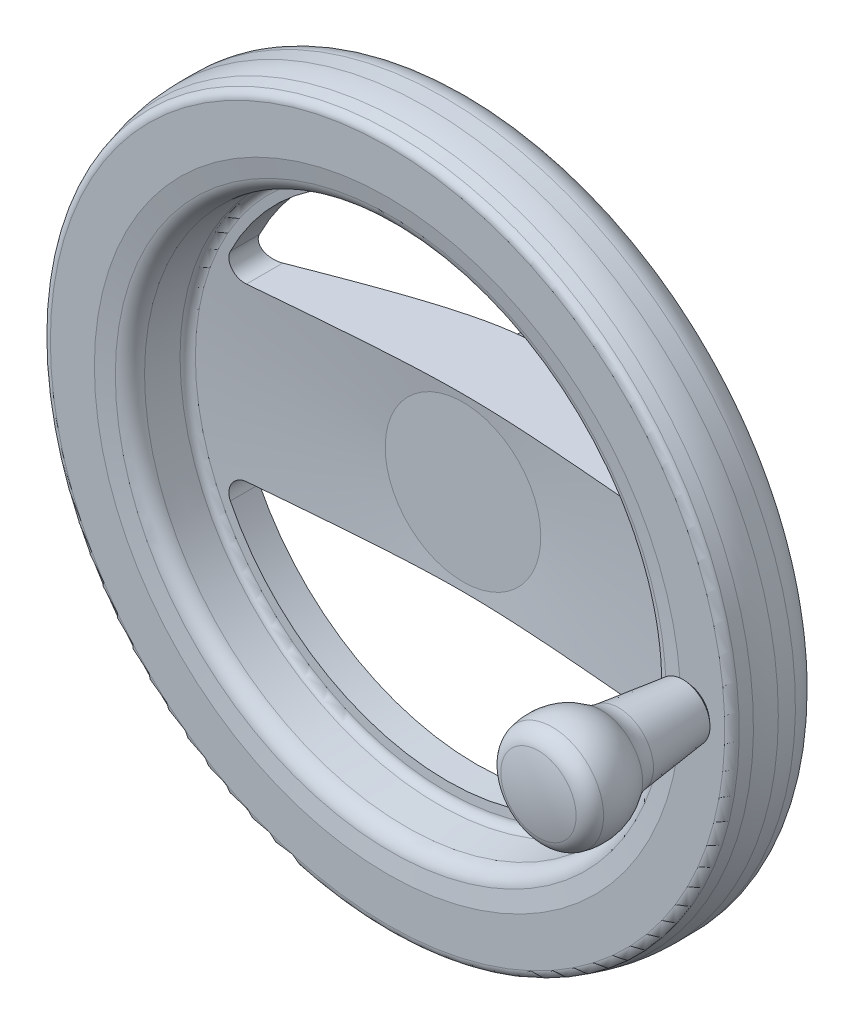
ISO-10303-21;
HEADER;
FILE_DESCRIPTION(('STEP AP214'),'2;1');
FILE_NAME('part.step','',(''),(''),'','','');
FILE_SCHEMA(('AUTOMOTIVE_DESIGN { 1 0 10303 214 1 1 1 1 }'));
ENDSEC;
DATA;
#1=APPLICATION_CONTEXT('core data for automotive mechanical design processes');
#2=APPLICATION_PROTOCOL_DEFINITION('international standard','automotive_design',2000,#1);
#3=PRODUCT_CONTEXT('',#1,'mechanical');
#4=PRODUCT('Part','Part','',(#3));
#5=PRODUCT_RELATED_PRODUCT_CATEGORY('part','',(#4));
#6=PRODUCT_DEFINITION_FORMATION('','',#4);
#7=PRODUCT_DEFINITION_CONTEXT('part definition',#1,'design');
#8=PRODUCT_DEFINITION('design','',#6,#7);
#9=PRODUCT_DEFINITION_SHAPE('','',#8);
#10=(LENGTH_UNIT() NAMED_UNIT(*) SI_UNIT(.MILLI.,.METRE.));
#11=(NAMED_UNIT(*) PLANE_ANGLE_UNIT() SI_UNIT($,.RADIAN.));
#12=(NAMED_UNIT(*) SI_UNIT($,.STERADIAN.) SOLID_ANGLE_UNIT());
#13=UNCERTAINTY_MEASURE_WITH_UNIT(LENGTH_MEASURE(1.E-05),#10,'distance_accuracy_value','');
#14=(GEOMETRIC_REPRESENTATION_CONTEXT(3) GLOBAL_UNCERTAINTY_ASSIGNED_CONTEXT((#13)) GLOBAL_UNIT_ASSIGNED_CONTEXT((#10,
#11,#12)) REPRESENTATION_CONTEXT('',''));
#15=CARTESIAN_POINT('',(0.,0.,0.));
#16=DIRECTION('',(0.,0.,1.));
#17=DIRECTION('',(1.,0.,0.));
#18=AXIS2_PLACEMENT_3D('',#15,#16,#17);
#19=CARTESIAN_POINT('',(127.,-2.04,61.));
#20=DIRECTION('',(0.,0.,-1.));
#21=DIRECTION('',(1.,0.,0.));
#22=AXIS2_PLACEMENT_3D('',#19,#20,#21);
#23=PLANE('',#22);
#24=CARTESIAN_POINT('',(127.,0.,60.9999999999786));
#25=DIRECTION('',(0.,0.,1.));
#26=DIRECTION('',(0.,-1.,0.));
#27=AXIS2_PLACEMENT_3D('',#24,#25,#26);
#28=CIRCLE('',#27,4.07999999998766);
#29=CARTESIAN_POINT('',(127.,-4.07999999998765,60.9999999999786));
#30=VERTEX_POINT('',#29);
#31=EDGE_CURVE('E401',#30,#30,#28,.T.);
#32=ORIENTED_EDGE('',*,*,#31,.F.);
#33=EDGE_LOOP('',(#32));
#34=FACE_BOUND('',#33,.T.);
#35=DIRECTION('',(-0.86602540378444,-0.5,0.));
#36=VECTOR('',#35,1.);
#37=CARTESIAN_POINT('',(127.,2.88675134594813,61.));
#38=LINE('',#37,#36);
#39=CARTESIAN_POINT('',(127.,2.88675134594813,61.));
#40=VERTEX_POINT('',#39);
#41=CARTESIAN_POINT('',(124.5,1.44337567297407,61.));
#42=VERTEX_POINT('',#41);
#43=EDGE_CURVE('E402',#40,#42,#38,.T.);
#44=ORIENTED_EDGE('',*,*,#43,.T.);
#45=DIRECTION('',(0.,-1.,0.));
#46=VECTOR('',#45,1.);
#47=CARTESIAN_POINT('',(124.5,-2.04,61.));
#48=LINE('',#47,#46);
#49=CARTESIAN_POINT('',(124.5,-1.44337567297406,61.));
#50=VERTEX_POINT('',#49);
#51=EDGE_CURVE('E398',#42,#50,#48,.T.);
#52=ORIENTED_EDGE('',*,*,#51,.T.);
#53=DIRECTION('',(0.866025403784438,-0.5,0.));
#54=VECTOR('',#53,1.);
#55=CARTESIAN_POINT('',(124.5,-1.44337567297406,61.));
#56=LINE('',#55,#54);
#57=CARTESIAN_POINT('',(127.,-2.88675134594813,61.));
#58=VERTEX_POINT('',#57);
#59=EDGE_CURVE('E414',#50,#58,#56,.T.);
#60=ORIENTED_EDGE('',*,*,#59,.T.);
#61=DIRECTION('',(0.866025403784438,0.5,0.));
#62=VECTOR('',#61,1.);
#63=CARTESIAN_POINT('',(127.,-2.88675134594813,61.));
#64=LINE('',#63,#62);
#65=CARTESIAN_POINT('',(129.5,-1.44337567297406,61.));
#66=VERTEX_POINT('',#65);
#67=EDGE_CURVE('E411',#58,#66,#64,.T.);
#68=ORIENTED_EDGE('',*,*,#67,.T.);
#69=DIRECTION('',(0.,-1.,0.));
#70=VECTOR('',#69,1.);
#71=CARTESIAN_POINT('',(129.5,-2.04,61.));
#72=LINE('',#71,#70);
#73=CARTESIAN_POINT('',(129.5,1.44337567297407,61.));
#74=VERTEX_POINT('',#73);
#75=EDGE_CURVE('E408',#66,#74,#72,.F.);
#76=ORIENTED_EDGE('',*,*,#75,.T.);
#77=DIRECTION('',(-0.86602540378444,0.5,0.));
#78=VECTOR('',#77,1.);
#79=CARTESIAN_POINT('',(129.5,1.44337567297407,61.));
#80=LINE('',#79,#78);
#81=EDGE_CURVE('E405',#74,#40,#80,.T.);
#82=ORIENTED_EDGE('',*,*,#81,.T.);
#83=EDGE_LOOP('',(#44,#52,#60,#68,#76,#82));
#84=FACE_BOUND('',#83,.T.);
#85=ADVANCED_FACE('F14',(#34,#84),#23,.T.);
#86=CARTESIAN_POINT('',(124.5,1.44337567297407,65.25));
#87=DIRECTION('',(-1.,0.,0.));
#88=DIRECTION('',(0.,-1.,0.));
#89=AXIS2_PLACEMENT_3D('',#86,#87,#88);
#90=PLANE('',#89);
#91=DIRECTION('',(0.,0.,1.));
#92=VECTOR('',#91,1.);
#93=CARTESIAN_POINT('',(124.5,1.44337567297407,65.25));
#94=LINE('',#93,#92);
#95=CARTESIAN_POINT('',(124.5,1.44337567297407,65.25));
#96=VERTEX_POINT('',#95);
#97=EDGE_CURVE('E417',#96,#42,#94,.F.);
#98=ORIENTED_EDGE('',*,*,#97,.F.);
#99=DIRECTION('',(0.,-1.,0.));
#100=VECTOR('',#99,1.);
#101=CARTESIAN_POINT('',(124.5,0.,65.25));
#102=LINE('',#101,#100);
#103=CARTESIAN_POINT('',(124.500000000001,0.,65.2499999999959));
#104=VERTEX_POINT('',#103);
#105=EDGE_CURVE('E462',#96,#104,#102,.T.);
#106=ORIENTED_EDGE('',*,*,#105,.T.);
#107=DIRECTION('',(0.,-1.,0.));
#108=VECTOR('',#107,1.);
#109=CARTESIAN_POINT('',(124.5,0.,65.25));
#110=LINE('',#109,#108);
#111=CARTESIAN_POINT('',(124.5,-1.44337567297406,65.25));
#112=VERTEX_POINT('',#111);
#113=EDGE_CURVE('E459',#104,#112,#110,.T.);
#114=ORIENTED_EDGE('',*,*,#113,.T.);
#115=DIRECTION('',(0.,0.,1.));
#116=VECTOR('',#115,1.);
#117=CARTESIAN_POINT('',(124.5,-1.44337567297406,65.25));
#118=LINE('',#117,#116);
#119=EDGE_CURVE('E429',#50,#112,#118,.T.);
#120=ORIENTED_EDGE('',*,*,#119,.F.);
#121=ORIENTED_EDGE('',*,*,#51,.F.);
#122=EDGE_LOOP('',(#98,#106,#114,#120,#121));
#123=FACE_BOUND('',#122,.T.);
#124=ADVANCED_FACE('F519',(#123),#90,.F.);
#125=CARTESIAN_POINT('',(127.,2.88675134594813,65.25));
#126=DIRECTION('',(-0.5,0.866025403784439,0.));
#127=DIRECTION('',(-0.866025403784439,-0.5,0.));
#128=AXIS2_PLACEMENT_3D('',#125,#126,#127);
#129=PLANE('',#128);
#130=DIRECTION('',(0.,0.,1.));
#131=VECTOR('',#130,1.);
#132=CARTESIAN_POINT('',(127.,2.88675134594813,65.25));
#133=LINE('',#132,#131);
#134=CARTESIAN_POINT('',(127.,2.88675134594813,65.25));
#135=VERTEX_POINT('',#134);
#136=EDGE_CURVE('E421',#135,#40,#133,.F.);
#137=ORIENTED_EDGE('',*,*,#136,.F.);
#138=DIRECTION('',(-0.866025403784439,-0.5,0.));
#139=VECTOR('',#138,1.);
#140=CARTESIAN_POINT('',(127.,2.88675134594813,65.25));
#141=LINE('',#140,#139);
#142=CARTESIAN_POINT('',(125.75,2.16506350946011,65.2499999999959));
#143=VERTEX_POINT('',#142);
#144=EDGE_CURVE('E418',#143,#135,#141,.F.);
#145=ORIENTED_EDGE('',*,*,#144,.F.);
#146=DIRECTION('',(-0.86602540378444,-0.5,0.));
#147=VECTOR('',#146,1.);
#148=CARTESIAN_POINT('',(125.75,2.1650635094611,65.25));
#149=LINE('',#148,#147);
#150=EDGE_CURVE('E465',#143,#96,#149,.T.);
#151=ORIENTED_EDGE('',*,*,#150,.T.);
#152=ORIENTED_EDGE('',*,*,#97,.T.);
#153=ORIENTED_EDGE('',*,*,#43,.F.);
#154=EDGE_LOOP('',(#137,#145,#151,#152,#153));
#155=FACE_BOUND('',#154,.T.);
#156=ADVANCED_FACE('F523',(#155),#129,.F.);
#157=CARTESIAN_POINT('',(129.5,1.44337567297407,65.25));
#158=DIRECTION('',(0.5,0.866025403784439,0.));
#159=DIRECTION('',(-0.866025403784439,0.5,0.));
#160=AXIS2_PLACEMENT_3D('',#157,#158,#159);
#161=PLANE('',#160);
#162=DIRECTION('',(0.,0.,1.));
#163=VECTOR('',#162,1.);
#164=CARTESIAN_POINT('',(129.5,1.44337567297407,65.25));
#165=LINE('',#164,#163);
#166=CARTESIAN_POINT('',(129.5,1.44337567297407,65.25));
#167=VERTEX_POINT('',#166);
#168=EDGE_CURVE('E422',#167,#74,#165,.F.);
#169=ORIENTED_EDGE('',*,*,#168,.F.);
#170=DIRECTION('',(-0.86602540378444,0.5,0.));
#171=VECTOR('',#170,1.);
#172=CARTESIAN_POINT('',(129.5,1.44337567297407,65.25));
#173=LINE('',#172,#171);
#174=CARTESIAN_POINT('',(128.25,2.16506350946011,65.2499999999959));
#175=VERTEX_POINT('',#174);
#176=EDGE_CURVE('E449',#167,#175,#173,.T.);
#177=ORIENTED_EDGE('',*,*,#176,.T.);
#178=DIRECTION('',(-0.866025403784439,0.5,0.));
#179=VECTOR('',#178,1.);
#180=CARTESIAN_POINT('',(129.5,1.44337567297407,65.25));
#181=LINE('',#180,#179);
#182=EDGE_CURVE('E423',#135,#175,#181,.F.);
#183=ORIENTED_EDGE('',*,*,#182,.F.);
#184=ORIENTED_EDGE('',*,*,#136,.T.);
#185=ORIENTED_EDGE('',*,*,#81,.F.);
#186=EDGE_LOOP('',(#169,#177,#183,#184,#185));
#187=FACE_BOUND('',#186,.T.);
#188=ADVANCED_FACE('F527',(#187),#161,.F.);
#189=CARTESIAN_POINT('',(129.5,-1.44337567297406,65.25));
#190=DIRECTION('',(1.,0.,0.));
#191=DIRECTION('',(0.,1.,0.));
#192=AXIS2_PLACEMENT_3D('',#189,#190,#191);
#193=PLANE('',#192);
#194=DIRECTION('',(0.,0.,1.));
#195=VECTOR('',#194,1.);
#196=CARTESIAN_POINT('',(129.5,-1.44337567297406,65.25));
#197=LINE('',#196,#195);
#198=CARTESIAN_POINT('',(129.5,-1.44337567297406,65.25));
#199=VERTEX_POINT('',#198);
#200=EDGE_CURVE('E426',#199,#66,#197,.F.);
#201=ORIENTED_EDGE('',*,*,#200,.F.);
#202=DIRECTION('',(0.,-1.,0.));
#203=VECTOR('',#202,1.);
#204=CARTESIAN_POINT('',(129.5,0.,65.25));
#205=LINE('',#204,#203);
#206=CARTESIAN_POINT('',(129.5,0.,65.2499999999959));
#207=VERTEX_POINT('',#206);
#208=EDGE_CURVE('E443',#199,#207,#205,.F.);
#209=ORIENTED_EDGE('',*,*,#208,.T.);
#210=DIRECTION('',(0.,-1.,0.));
#211=VECTOR('',#210,1.);
#212=CARTESIAN_POINT('',(129.5,0.,65.25));
#213=LINE('',#212,#211);
#214=EDGE_CURVE('E453',#207,#167,#213,.F.);
#215=ORIENTED_EDGE('',*,*,#214,.T.);
#216=ORIENTED_EDGE('',*,*,#168,.T.);
#217=ORIENTED_EDGE('',*,*,#75,.F.);
#218=EDGE_LOOP('',(#201,#209,#215,#216,#217));
#219=FACE_BOUND('',#218,.T.);
#220=ADVANCED_FACE('F531',(#219),#193,.F.);
#221=CARTESIAN_POINT('',(127.,-2.88675134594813,65.25));
#222=DIRECTION('',(0.5,-0.866025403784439,0.));
#223=DIRECTION('',(0.866025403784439,0.5,0.));
#224=AXIS2_PLACEMENT_3D('',#221,#222,#223);
#225=PLANE('',#224);
#226=DIRECTION('',(0.,0.,1.));
#227=VECTOR('',#226,1.);
#228=CARTESIAN_POINT('',(127.,-2.88675134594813,65.25));
#229=LINE('',#228,#227);
#230=CARTESIAN_POINT('',(127.,-2.88675134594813,65.25));
#231=VERTEX_POINT('',#230);
#232=EDGE_CURVE('E437',#231,#58,#229,.F.);
#233=ORIENTED_EDGE('',*,*,#232,.F.);
#234=DIRECTION('',(0.866025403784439,0.5,0.));
#235=VECTOR('',#234,1.);
#236=CARTESIAN_POINT('',(127.,-2.88675134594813,65.25));
#237=LINE('',#236,#235);
#238=CARTESIAN_POINT('',(128.25,-2.16506350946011,65.2499999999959));
#239=VERTEX_POINT('',#238);
#240=EDGE_CURVE('E433',#239,#231,#237,.F.);
#241=ORIENTED_EDGE('',*,*,#240,.F.);
#242=DIRECTION('',(0.866025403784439,0.5,0.));
#243=VECTOR('',#242,1.);
#244=CARTESIAN_POINT('',(127.,-2.88675134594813,65.25));
#245=LINE('',#244,#243);
#246=EDGE_CURVE('E430',#199,#239,#245,.F.);
#247=ORIENTED_EDGE('',*,*,#246,.F.);
#248=ORIENTED_EDGE('',*,*,#200,.T.);
#249=ORIENTED_EDGE('',*,*,#67,.F.);
#250=EDGE_LOOP('',(#233,#241,#247,#248,#249));
#251=FACE_BOUND('',#250,.T.);
#252=ADVANCED_FACE('F535',(#251),#225,.F.);
#253=CARTESIAN_POINT('',(124.5,-1.44337567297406,65.25));
#254=DIRECTION('',(-0.5,-0.866025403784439,0.));
#255=DIRECTION('',(0.866025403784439,-0.5,0.));
#256=AXIS2_PLACEMENT_3D('',#253,#254,#255);
#257=PLANE('',#256);
#258=ORIENTED_EDGE('',*,*,#119,.T.);
#259=DIRECTION('',(0.86602540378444,-0.5,0.));
#260=VECTOR('',#259,1.);
#261=CARTESIAN_POINT('',(124.5,-1.44337567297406,65.25));
#262=LINE('',#261,#260);
#263=CARTESIAN_POINT('',(125.75,-2.16506350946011,65.2499999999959));
#264=VERTEX_POINT('',#263);
#265=EDGE_CURVE('E456',#112,#264,#262,.T.);
#266=ORIENTED_EDGE('',*,*,#265,.T.);
#267=DIRECTION('',(0.866025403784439,-0.5,0.));
#268=VECTOR('',#267,1.);
#269=CARTESIAN_POINT('',(124.5,-1.44337567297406,65.25));
#270=LINE('',#269,#268);
#271=EDGE_CURVE('E434',#231,#264,#270,.F.);
#272=ORIENTED_EDGE('',*,*,#271,.F.);
#273=ORIENTED_EDGE('',*,*,#232,.T.);
#274=ORIENTED_EDGE('',*,*,#59,.F.);
#275=EDGE_LOOP('',(#258,#266,#272,#273,#274));
#276=FACE_BOUND('',#275,.T.);
#277=ADVANCED_FACE('F539',(#276),#257,.F.);
#278=CARTESIAN_POINT('',(127.,0.,65.25));
#279=DIRECTION('',(0.,0.,1.));
#280=DIRECTION('',(0.,-1.,0.));
#281=AXIS2_PLACEMENT_3D('',#278,#279,#280);
#282=PLANE('',#281);
#283=CARTESIAN_POINT('',(127.,0.,65.2499999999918));
#284=DIRECTION('',(0.,0.,-1.));
#285=DIRECTION('',(0.,1.,0.));
#286=AXIS2_PLACEMENT_3D('',#283,#284,#285);
#287=CIRCLE('',#286,2.49999999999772);
#288=EDGE_CURVE('E446',#175,#143,#287,.F.);
#289=ORIENTED_EDGE('',*,*,#288,.T.);
#290=ORIENTED_EDGE('',*,*,#144,.T.);
#291=ORIENTED_EDGE('',*,*,#182,.T.);
#292=EDGE_LOOP('',(#289,#290,#291));
#293=FACE_BOUND('',#292,.T.);
#294=ADVANCED_FACE('F543',(#293),#282,.F.);
#295=CARTESIAN_POINT('',(127.,0.,65.25));
#296=DIRECTION('',(0.,0.,1.));
#297=DIRECTION('',(0.,-1.,0.));
#298=AXIS2_PLACEMENT_3D('',#295,#296,#297);
#299=PLANE('',#298);
#300=CARTESIAN_POINT('',(127.,0.,65.2499999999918));
#301=DIRECTION('',(0.,0.,-1.));
#302=DIRECTION('',(0.,1.,0.));
#303=AXIS2_PLACEMENT_3D('',#300,#301,#302);
#304=CIRCLE('',#303,2.49999999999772);
#305=EDGE_CURVE('E487',#264,#239,#304,.F.);
#306=ORIENTED_EDGE('',*,*,#305,.T.);
#307=ORIENTED_EDGE('',*,*,#240,.T.);
#308=ORIENTED_EDGE('',*,*,#271,.T.);
#309=EDGE_LOOP('',(#306,#307,#308));
#310=FACE_BOUND('',#309,.T.);
#311=ADVANCED_FACE('F547',(#310),#299,.F.);
#312=CARTESIAN_POINT('',(127.,0.,65.25));
#313=DIRECTION('',(0.,0.,1.));
#314=DIRECTION('',(0.,-1.,0.));
#315=AXIS2_PLACEMENT_3D('',#312,#313,#314);
#316=PLANE('',#315);
#317=ORIENTED_EDGE('',*,*,#208,.F.);
#318=ORIENTED_EDGE('',*,*,#246,.T.);
#319=CARTESIAN_POINT('',(127.,0.,65.2499999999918));
#320=DIRECTION('',(0.,0.,-1.));
#321=DIRECTION('',(0.,1.,0.));
#322=AXIS2_PLACEMENT_3D('',#319,#320,#321);
#323=CIRCLE('',#322,2.49999999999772);
#324=EDGE_CURVE('E440',#207,#239,#323,.T.);
#325=ORIENTED_EDGE('',*,*,#324,.F.);
#326=EDGE_LOOP('',(#317,#318,#325));
#327=FACE_BOUND('',#326,.T.);
#328=ADVANCED_FACE('F551',(#327),#316,.F.);
#329=CARTESIAN_POINT('',(127.,0.,65.2499999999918));
#330=DIRECTION('',(0.,0.,-1.));
#331=DIRECTION('',(0.,1.,0.));
#332=AXIS2_PLACEMENT_3D('',#329,#330,#331);
#333=CONICAL_SURFACE('',#332,2.49999999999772,1.04719755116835);
#334=CARTESIAN_POINT('',(127.,2.8421709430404E-11,66.6933756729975));
#335=VERTEX_POINT('',#334);
#336=VERTEX_LOOP('',#335);
#337=FACE_BOUND('',#336,.T.);
#338=CARTESIAN_POINT('',(127.,0.,65.2499999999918));
#339=DIRECTION('',(0.,0.,-1.));
#340=DIRECTION('',(0.,1.,0.));
#341=AXIS2_PLACEMENT_3D('',#338,#339,#340);
#342=CIRCLE('',#341,2.49999999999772);
#343=EDGE_CURVE('E452',#143,#104,#342,.F.);
#344=ORIENTED_EDGE('',*,*,#343,.F.);
#345=ORIENTED_EDGE('',*,*,#288,.F.);
#346=CARTESIAN_POINT('',(127.,0.,65.2499999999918));
#347=DIRECTION('',(0.,0.,-1.));
#348=DIRECTION('',(0.,1.,0.));
#349=AXIS2_PLACEMENT_3D('',#346,#347,#348);
#350=CIRCLE('',#349,2.49999999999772);
#351=EDGE_CURVE('E484',#207,#175,#350,.F.);
#352=ORIENTED_EDGE('',*,*,#351,.F.);
#353=ORIENTED_EDGE('',*,*,#324,.T.);
#354=ORIENTED_EDGE('',*,*,#305,.F.);
#355=CARTESIAN_POINT('',(127.,0.,65.2499999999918));
#356=DIRECTION('',(0.,0.,-1.));
#357=DIRECTION('',(0.,1.,0.));
#358=AXIS2_PLACEMENT_3D('',#355,#356,#357);
#359=CIRCLE('',#358,2.49999999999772);
#360=EDGE_CURVE('E490',#104,#264,#359,.F.);
#361=ORIENTED_EDGE('',*,*,#360,.F.);
#362=EDGE_LOOP('',(#344,#345,#352,#353,#354,#361));
#363=FACE_BOUND('',#362,.T.);
#364=ADVANCED_FACE('F555',(#337,#363),#333,.F.);
#365=CARTESIAN_POINT('',(127.,0.,65.25));
#366=DIRECTION('',(0.,0.,1.));
#367=DIRECTION('',(0.,-1.,0.));
#368=AXIS2_PLACEMENT_3D('',#365,#366,#367);
#369=PLANE('',#368);
#370=ORIENTED_EDGE('',*,*,#176,.F.);
#371=ORIENTED_EDGE('',*,*,#214,.F.);
#372=ORIENTED_EDGE('',*,*,#351,.T.);
#373=EDGE_LOOP('',(#370,#371,#372));
#374=FACE_BOUND('',#373,.T.);
#375=ADVANCED_FACE('F559',(#374),#369,.F.);
#376=CARTESIAN_POINT('',(127.,0.,65.25));
#377=DIRECTION('',(0.,0.,1.));
#378=DIRECTION('',(0.,-1.,0.));
#379=AXIS2_PLACEMENT_3D('',#376,#377,#378);
#380=PLANE('',#379);
#381=ORIENTED_EDGE('',*,*,#265,.F.);
#382=ORIENTED_EDGE('',*,*,#113,.F.);
#383=ORIENTED_EDGE('',*,*,#360,.T.);
#384=EDGE_LOOP('',(#381,#382,#383));
#385=FACE_BOUND('',#384,.T.);
#386=ADVANCED_FACE('F563',(#385),#380,.F.);
#387=CARTESIAN_POINT('',(127.,0.,65.25));
#388=DIRECTION('',(0.,0.,1.));
#389=DIRECTION('',(0.,-1.,0.));
#390=AXIS2_PLACEMENT_3D('',#387,#388,#389);
#391=PLANE('',#390);
#392=ORIENTED_EDGE('',*,*,#105,.F.);
#393=ORIENTED_EDGE('',*,*,#150,.F.);
#394=ORIENTED_EDGE('',*,*,#343,.T.);
#395=EDGE_LOOP('',(#392,#393,#394));
#396=FACE_BOUND('',#395,.T.);
#397=ADVANCED_FACE('F515',(#396),#391,.F.);
#398=CARTESIAN_POINT('',(127.,0.,61.9199999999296));
#399=DIRECTION('',(0.,0.,1.));
#400=DIRECTION('',(0.,-1.,0.));
#401=AXIS2_PLACEMENT_3D('',#398,#399,#400);
#402=CONICAL_SURFACE('',#401,4.99999999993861,0.785398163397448);
#403=ORIENTED_EDGE('',*,*,#31,.T.);
#404=EDGE_LOOP('',(#403));
#405=FACE_BOUND('',#404,.T.);
#406=CARTESIAN_POINT('',(127.,0.,61.107999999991));
#407=DIRECTION('',(0.,0.,1.));
#408=DIRECTION('',(0.,-1.,0.));
#409=AXIS2_PLACEMENT_3D('',#406,#407,#408);
#410=CIRCLE('',#409,4.188);
#411=CARTESIAN_POINT('',(127.,-4.188,61.107999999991));
#412=VERTEX_POINT('',#411);
#413=EDGE_CURVE('E9',#412,#412,#410,.F.);
#414=ORIENTED_EDGE('',*,*,#413,.T.);
#415=EDGE_LOOP('',(#414));
#416=FACE_BOUND('',#415,.T.);
#417=ADVANCED_FACE('F378',(#405,#416),#402,.T.);
#418=CARTESIAN_POINT('',(127.,0.,79.7284321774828));
#419=DIRECTION('',(0.,0.,1.));
#420=DIRECTION('',(-1.,0.,0.));
#421=AXIS2_PLACEMENT_3D('',#418,#419,#420);
#422=CONICAL_SURFACE('',#421,11.5,0.858106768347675);
#423=CARTESIAN_POINT('',(127.,0.,79.7284321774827));
#424=DIRECTION('',(0.,0.,1.));
#425=DIRECTION('',(0.,-1.,0.));
#426=AXIS2_PLACEMENT_3D('',#423,#424,#425);
#427=CIRCLE('',#426,11.5);
#428=CARTESIAN_POINT('',(127.,-11.5,79.7284321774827));
#429=VERTEX_POINT('',#428);
#430=EDGE_CURVE('E394',#429,#429,#427,.T.);
#431=ORIENTED_EDGE('',*,*,#430,.F.);
#432=EDGE_LOOP('',(#431));
#433=FACE_BOUND('',#432,.T.);
#434=CARTESIAN_POINT('',(127.,0.,78.));
#435=DIRECTION('',(0.,0.,1.));
#436=DIRECTION('',(-1.,0.,0.));
#437=AXIS2_PLACEMENT_3D('',#434,#435,#436);
#438=CIRCLE('',#437,9.5);
#439=CARTESIAN_POINT('',(124.034921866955,-9.02542584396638,78.));
#440=VERTEX_POINT('',#439);
#441=CARTESIAN_POINT('',(124.034921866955,9.02542584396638,78.));
#442=VERTEX_POINT('',#441);
#443=EDGE_CURVE('E397',#440,#442,#438,.T.);
#444=ORIENTED_EDGE('',*,*,#443,.T.);
#445=EDGE_CURVE('E477',#442,#440,#438,.T.);
#446=ORIENTED_EDGE('',*,*,#445,.T.);
#447=EDGE_LOOP('',(#444,#446));
#448=FACE_BOUND('',#447,.T.);
#449=ADVANCED_FACE('F364',(#433,#448),#422,.T.);
#450=CARTESIAN_POINT('',(127.,0.,106.95784489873));
#451=DIRECTION('',(0.,0.,1.));
#452=DIRECTION('',(-1.,0.,0.));
#453=AXIS2_PLACEMENT_3D('',#450,#451,#452);
#454=CONICAL_SURFACE('',#453,14.7528672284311,0.118898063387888);
#455=CARTESIAN_POINT('',(127.,0.,106.95784489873));
#456=DIRECTION('',(0.,0.,1.));
#457=DIRECTION('',(1.,0.,0.));
#458=AXIS2_PLACEMENT_3D('',#455,#456,#457);
#459=CIRCLE('',#458,14.752867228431);
#460=CARTESIAN_POINT('',(141.752867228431,0.,106.95784489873));
#461=VERTEX_POINT('',#460);
#462=EDGE_CURVE('E1299',#461,#461,#459,.F.);
#463=ORIENTED_EDGE('',*,*,#462,.T.);
#464=EDGE_LOOP('',(#463));
#465=FACE_BOUND('',#464,.T.);
#466=ORIENTED_EDGE('',*,*,#430,.T.);
#467=EDGE_LOOP('',(#466));
#468=FACE_BOUND('',#467,.T.);
#469=ADVANCED_FACE('F387',(#465,#468),#454,.T.);
#470=CARTESIAN_POINT('',(127.,-7.75,78.));
#471=DIRECTION('',(0.,0.,-1.));
#472=DIRECTION('',(1.,0.,0.));
#473=AXIS2_PLACEMENT_3D('',#470,#471,#472);
#474=PLANE('',#473);
#475=CARTESIAN_POINT('',(127.,0.,78.));
#476=DIRECTION('',(0.,0.,-1.));
#477=DIRECTION('',(-0.432972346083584,-0.901407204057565,0.));
#478=AXIS2_PLACEMENT_3D('',#475,#476,#477);
#479=CIRCLE('',#478,6.40000000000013);
#480=CARTESIAN_POINT('',(124.228976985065,-5.76900610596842,78.));
#481=VERTEX_POINT('',#480);
#482=CARTESIAN_POINT('',(124.228976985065,5.76900610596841,78.));
#483=VERTEX_POINT('',#482);
#484=EDGE_CURVE('E497',#481,#483,#479,.T.);
#485=ORIENTED_EDGE('',*,*,#484,.F.);
#486=CARTESIAN_POINT('',(0.,0.,78.));
#487=DIRECTION('',(0.,0.,-1.));
#488=DIRECTION('',(1.,0.,0.));
#489=AXIS2_PLACEMENT_3D('',#486,#487,#488);
#490=CIRCLE('',#489,124.362856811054);
#491=EDGE_CURVE('E23',#481,#440,#490,.T.);
#492=ORIENTED_EDGE('',*,*,#491,.T.);
#493=ORIENTED_EDGE('',*,*,#445,.F.);
#494=EDGE_CURVE('E31',#442,#483,#490,.T.);
#495=ORIENTED_EDGE('',*,*,#494,.T.);
#496=EDGE_LOOP('',(#485,#492,#493,#495));
#497=FACE_BOUND('',#496,.T.);
#498=ADVANCED_FACE('F503',(#497),#474,.T.);
#499=CARTESIAN_POINT('',(127.,0.,105.059954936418));
#500=DIRECTION('',(0.,0.,1.));
#501=DIRECTION('',(1.,0.,0.));
#502=AXIS2_PLACEMENT_3D('',#499,#500,#501);
#503=TOROIDAL_SURFACE('',#502,30.6399064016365,16.0000000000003);
#504=ORIENTED_EDGE('',*,*,#462,.F.);
#505=EDGE_LOOP('',(#504));
#506=FACE_BOUND('',#505,.T.);
#507=CARTESIAN_POINT('',(127.,0.,114.480499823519));
#508=DIRECTION('',(0.,0.,1.));
#509=DIRECTION('',(1.,0.,0.));
#510=AXIS2_PLACEMENT_3D('',#507,#508,#509);
#511=CIRCLE('',#510,17.70726034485);
#512=CARTESIAN_POINT('',(144.70726034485,0.,114.480499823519));
#513=VERTEX_POINT('',#512);
#514=EDGE_CURVE('E1303',#513,#513,#511,.T.);
#515=ORIENTED_EDGE('',*,*,#514,.F.);
#516=EDGE_LOOP('',(#515));
#517=FACE_BOUND('',#516,.T.);
#518=ADVANCED_FACE('F512',(#506,#517),#503,.F.);
#519=CARTESIAN_POINT('',(124.499981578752,0.,129.200108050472));
#520=DIRECTION('',(0.,1.,0.));
#521=DIRECTION('',(1.,0.,0.));
#522=AXIS2_PLACEMENT_3D('',#519,#520,#521);
#523=CIRCLE('',#522,25.0000196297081);
#524=TRIMMED_CURVE('',#523,(PARAMETER_VALUE(-1.47062824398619)),
(PARAMETER_VALUE(1.47062824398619)),.T.,.PARAMETER.);
#525=CARTESIAN_POINT('',(127.,0.,129.200108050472));
#526=DIRECTION('',(0.,0.,1.));
#527=AXIS1_PLACEMENT('',#525,#526);
#528=SURFACE_OF_REVOLUTION('',#524,#527);
#529=CARTESIAN_POINT('',(127.,0.,135.157897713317));
#530=DIRECTION('',(0.,0.,1.));
#531=DIRECTION('',(1.,0.,0.));
#532=AXIS2_PLACEMENT_3D('',#529,#530,#531);
#533=CIRCLE('',#532,21.7797205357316);
#534=CARTESIAN_POINT('',(148.779720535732,0.,135.157897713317));
#535=VERTEX_POINT('',#534);
#536=EDGE_CURVE('E1297',#535,#535,#533,.F.);
#537=ORIENTED_EDGE('',*,*,#536,.T.);
#538=EDGE_LOOP('',(#537));
#539=FACE_BOUND('',#538,.T.);
#540=ORIENTED_EDGE('',*,*,#514,.T.);
#541=EDGE_LOOP('',(#540));
#542=FACE_BOUND('',#541,.T.);
#543=ADVANCED_FACE('F379',(#539,#542),#528,.F.);
#544=CARTESIAN_POINT('',(127.,0.,133.251386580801));
#545=DIRECTION('',(0.,0.,1.));
#546=DIRECTION('',(1.,0.,0.));
#547=AXIS2_PLACEMENT_3D('',#544,#545,#546);
#548=TOROIDAL_SURFACE('',#547,14.0102198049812,7.99999539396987);
#549=CARTESIAN_POINT('',(127.,0.,141.005948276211));
#550=DIRECTION('',(0.,0.,1.));
#551=DIRECTION('',(1.,0.,0.));
#552=AXIS2_PLACEMENT_3D('',#549,#550,#551);
#553=CIRCLE('',#552,15.9766122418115);
#554=CARTESIAN_POINT('',(142.976612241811,0.,141.005948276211));
#555=VERTEX_POINT('',#554);
#556=EDGE_CURVE('E392',#555,#555,#553,.F.);
#557=ORIENTED_EDGE('',*,*,#556,.T.);
#558=EDGE_LOOP('',(#557));
#559=FACE_BOUND('',#558,.T.);
#560=ORIENTED_EDGE('',*,*,#536,.F.);
#561=EDGE_LOOP('',(#560));
#562=FACE_BOUND('',#561,.T.);
#563=ADVANCED_FACE('F369',(#559,#562),#548,.T.);
#564=CARTESIAN_POINT('',(126.999948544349,0.,77.9991722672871));
#565=DIRECTION('',(0.,1.,0.));
#566=DIRECTION('',(1.,0.,0.));
#567=AXIS2_PLACEMENT_3D('',#564,#565,#566);
#568=CIRCLE('',#567,65.0008277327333);
#569=TRIMMED_CURVE('',#568,(PARAMETER_VALUE(-1.57079553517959)),
(PARAMETER_VALUE(1.57079553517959)),.T.,.PARAMETER.);
#570=CARTESIAN_POINT('',(127.,0.,77.9991722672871));
#571=DIRECTION('',(0.,0.,1.));
#572=AXIS1_PLACEMENT('',#570,#571);
#573=SURFACE_OF_REVOLUTION('',#569,#572);
#574=ORIENTED_EDGE('',*,*,#556,.F.);
#575=EDGE_LOOP('',(#574));
#576=FACE_BOUND('',#575,.T.);
#577=CARTESIAN_POINT('',(127.,0.,143.));
#578=VERTEX_POINT('',#577);
#579=VERTEX_LOOP('',#578);
#580=FACE_BOUND('',#579,.T.);
#581=ADVANCED_FACE('F367',(#576,#580),#573,.F.);
#582=CARTESIAN_POINT('',(127.,0.,63.));
#583=DIRECTION('',(0.,0.,1.));
#584=DIRECTION('',(0.,-1.,0.));
#585=AXIS2_PLACEMENT_3D('',#582,#583,#584);
#586=CYLINDRICAL_SURFACE('',#585,4.188);
#587=ORIENTED_EDGE('',*,*,#413,.F.);
#588=EDGE_LOOP('',(#587));
#589=FACE_BOUND('',#588,.T.);
#590=CARTESIAN_POINT('',(127.,0.,48.8120000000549));
#591=DIRECTION('',(0.,0.,-1.));
#592=DIRECTION('',(-1.,0.,0.));
#593=AXIS2_PLACEMENT_3D('',#590,#591,#592);
#594=CIRCLE('',#593,4.1879999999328);
#595=CARTESIAN_POINT('',(122.812000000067,0.,48.8120000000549));
#596=VERTEX_POINT('',#595);
#597=EDGE_CURVE('E134',#596,#596,#594,.T.);
#598=ORIENTED_EDGE('',*,*,#597,.T.);
#599=EDGE_LOOP('',(#598));
#600=FACE_BOUND('',#599,.T.);
#601=ADVANCED_FACE('F182',(#589,#600),#586,.F.);
#602=CARTESIAN_POINT('',(127.,0.,47.999999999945));
#603=DIRECTION('',(0.,0.,-1.));
#604=DIRECTION('',(0.,1.,0.));
#605=AXIS2_PLACEMENT_3D('',#602,#603,#604);
#606=CONICAL_SURFACE('',#605,5.00000000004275,0.785398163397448);
#607=CARTESIAN_POINT('',(127.,0.,47.999999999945));
#608=DIRECTION('',(0.,0.,-1.));
#609=DIRECTION('',(0.,1.,0.));
#610=AXIS2_PLACEMENT_3D('',#607,#608,#609);
#611=CIRCLE('',#610,5.00000000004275);
#612=CARTESIAN_POINT('',(127.,5.00000000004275,47.999999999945));
#613=VERTEX_POINT('',#612);
#614=EDGE_CURVE('E152',#613,#613,#611,.T.);
#615=ORIENTED_EDGE('',*,*,#614,.T.);
#616=EDGE_LOOP('',(#615));
#617=FACE_BOUND('',#616,.T.);
#618=ORIENTED_EDGE('',*,*,#597,.F.);
#619=EDGE_LOOP('',(#618));
#620=FACE_BOUND('',#619,.T.);
#621=ADVANCED_FACE('F376',(#617,#620),#606,.F.);
#622=CARTESIAN_POINT('',(121.166666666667,0.,48.));
#623=DIRECTION('',(0.,0.,1.));
#624=DIRECTION('',(0.,-1.,0.));
#625=AXIS2_PLACEMENT_3D('',#622,#623,#624);
#626=PLANE('',#625);
#627=ORIENTED_EDGE('',*,*,#614,.F.);
#628=EDGE_LOOP('',(#627));
#629=FACE_BOUND('',#628,.T.);
#630=CARTESIAN_POINT('',(127.,0.,48.));
#631=DIRECTION('',(0.,0.,1.));
#632=DIRECTION('',(0.,-1.,0.));
#633=AXIS2_PLACEMENT_3D('',#630,#631,#632);
#634=CIRCLE('',#633,6.66666666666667);
#635=CARTESIAN_POINT('',(127.,-6.66666666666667,48.));
#636=VERTEX_POINT('',#635);
#637=EDGE_CURVE('E646',#636,#636,#634,.F.);
#638=ORIENTED_EDGE('',*,*,#637,.T.);
#639=EDGE_LOOP('',(#638));
#640=FACE_BOUND('',#639,.T.);
#641=ADVANCED_FACE('F680',(#629,#640),#626,.F.);
#642=CARTESIAN_POINT('',(127.,0.,45.));
#643=DIRECTION('',(0.,0.,1.));
#644=DIRECTION('',(0.,-1.,0.));
#645=AXIS2_PLACEMENT_3D('',#642,#643,#644);
#646=CYLINDRICAL_SURFACE('',#645,6.66666666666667);
#647=CARTESIAN_POINT('',(127.,0.,42.));
#648=DIRECTION('',(0.,0.,1.));
#649=DIRECTION('',(0.,-1.,0.));
#650=AXIS2_PLACEMENT_3D('',#647,#648,#649);
#651=CIRCLE('',#650,6.66666666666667);
#652=CARTESIAN_POINT('',(127.,-6.66666666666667,42.));
#653=VERTEX_POINT('',#652);
#654=EDGE_CURVE('E633',#653,#653,#651,.T.);
#655=ORIENTED_EDGE('',*,*,#654,.F.);
#656=EDGE_LOOP('',(#655));
#657=FACE_BOUND('',#656,.T.);
#658=ORIENTED_EDGE('',*,*,#637,.F.);
#659=EDGE_LOOP('',(#658));
#660=FACE_BOUND('',#659,.T.);
#661=ADVANCED_FACE('F574',(#657,#660),#646,.F.);
#662=CARTESIAN_POINT('',(-122.475216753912,0.,42.));
#663=DIRECTION('',(0.,0.,-1.));
#664=DIRECTION('',(0.,1.,0.));
#665=AXIS2_PLACEMENT_3D('',#662,#663,#664);
#666=PLANE('',#665);
#667=CARTESIAN_POINT('',(0.,0.,42.));
#668=DIRECTION('',(0.,0.,1.));
#669=DIRECTION('',(0.,-1.,0.));
#670=AXIS2_PLACEMENT_3D('',#667,#668,#669);
#671=CIRCLE('',#670,137.);
#672=CARTESIAN_POINT('',(0.,137.,42.));
#673=VERTEX_POINT('',#672);
#674=CARTESIAN_POINT('',(0.,-137.,42.));
#675=VERTEX_POINT('',#674);
#676=EDGE_CURVE('E615',#673,#675,#671,.F.);
#677=ORIENTED_EDGE('',*,*,#676,.T.);
#678=CARTESIAN_POINT('',(0.,0.,42.));
#679=DIRECTION('',(0.,0.,1.));
#680=DIRECTION('',(-1.,0.,0.));
#681=AXIS2_PLACEMENT_3D('',#678,#679,#680);
#682=CIRCLE('',#681,137.);
#683=CARTESIAN_POINT('',(-137.,0.,42.));
#684=VERTEX_POINT('',#683);
#685=EDGE_CURVE('E468',#675,#684,#682,.F.);
#686=ORIENTED_EDGE('',*,*,#685,.T.);
#687=CARTESIAN_POINT('',(0.,0.,42.));
#688=DIRECTION('',(0.,0.,1.));
#689=DIRECTION('',(0.,1.,0.));
#690=AXIS2_PLACEMENT_3D('',#687,#688,#689);
#691=CIRCLE('',#690,137.);
#692=EDGE_CURVE('E624',#684,#673,#691,.F.);
#693=ORIENTED_EDGE('',*,*,#692,.T.);
#694=EDGE_LOOP('',(#677,#686,#693));
#695=FACE_BOUND('',#694,.T.);
#696=CARTESIAN_POINT('',(0.,0.,42.0000000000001));
#697=DIRECTION('',(0.,0.,-1.));
#698=DIRECTION('',(0.,-1.,0.));
#699=AXIS2_PLACEMENT_3D('',#696,#697,#698);
#700=CIRCLE('',#699,107.950433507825);
#701=CARTESIAN_POINT('',(-107.950433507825,0.,42.));
#702=VERTEX_POINT('',#701);
#703=CARTESIAN_POINT('',(0.,-107.950433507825,42.));
#704=VERTEX_POINT('',#703);
#705=EDGE_CURVE('E629',#702,#704,#700,.F.);
#706=ORIENTED_EDGE('',*,*,#705,.T.);
#707=CARTESIAN_POINT('',(0.,0.,42.0000000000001));
#708=DIRECTION('',(0.,0.,-1.));
#709=DIRECTION('',(0.,1.,0.));
#710=AXIS2_PLACEMENT_3D('',#707,#708,#709);
#711=CIRCLE('',#710,107.950433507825);
#712=CARTESIAN_POINT('',(0.,107.950433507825,42.));
#713=VERTEX_POINT('',#712);
#714=EDGE_CURVE('E627',#704,#713,#711,.F.);
#715=ORIENTED_EDGE('',*,*,#714,.T.);
#716=CARTESIAN_POINT('',(0.,0.,42.0000000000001));
#717=DIRECTION('',(0.,0.,-1.));
#718=DIRECTION('',(-1.,0.,0.));
#719=AXIS2_PLACEMENT_3D('',#716,#717,#718);
#720=CIRCLE('',#719,107.950433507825);
#721=EDGE_CURVE('E632',#713,#702,#720,.F.);
#722=ORIENTED_EDGE('',*,*,#721,.T.);
#723=EDGE_LOOP('',(#706,#715,#722));
#724=FACE_BOUND('',#723,.T.);
#725=ORIENTED_EDGE('',*,*,#654,.T.);
#726=EDGE_LOOP('',(#725));
#727=FACE_BOUND('',#726,.T.);
#728=ADVANCED_FACE('F316',(#695,#724,#727),#666,.T.);
#729=CARTESIAN_POINT('',(127.,0.,74.4));
#730=DIRECTION('',(0.,0.,-1.));
#731=DIRECTION('',(0.,1.,0.));
#732=AXIS2_PLACEMENT_3D('',#729,#730,#731);
#733=TOROIDAL_SURFACE('',#732,6.4,3.6);
#734=ORIENTED_EDGE('',*,*,#484,.T.);
#735=CARTESIAN_POINT('',(124.228976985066,5.76900610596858,78.));
#736=CARTESIAN_POINT('',(124.228166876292,5.78646007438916,78.0000000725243));
#737=CARTESIAN_POINT('',(124.226740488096,5.8038846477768,77.9998920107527));
#738=CARTESIAN_POINT('',(124.222556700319,5.83858653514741,77.9994415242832));
#739=CARTESIAN_POINT('',(124.219797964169,5.85586368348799,77.9990988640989));
#740=CARTESIAN_POINT('',(124.20940084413,5.90718250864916,77.9976949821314));
#741=CARTESIAN_POINT('',(124.19963771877,5.94082065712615,77.996258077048));
#742=CARTESIAN_POINT('',(124.174192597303,6.00593017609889,77.9923281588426));
#743=CARTESIAN_POINT('',(124.158477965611,6.03738844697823,77.9898293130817));
#744=CARTESIAN_POINT('',(124.121767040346,6.09688788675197,77.9838760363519));
#745=CARTESIAN_POINT('',(124.100775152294,6.12493187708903,77.9804224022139));
#746=CARTESIAN_POINT('',(124.050313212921,6.18199102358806,77.9720336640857));
#747=CARTESIAN_POINT('',(124.019993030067,6.21022446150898,77.9669426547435));
#748=CARTESIAN_POINT('',(123.955257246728,6.26139834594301,77.9559956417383));
#749=CARTESIAN_POINT('',(123.920829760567,6.28432283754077,77.9501374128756));
#750=CARTESIAN_POINT('',(123.829481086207,6.33682098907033,77.934521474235));
#751=CARTESIAN_POINT('',(123.77069500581,6.36300619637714,77.9244064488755));
#752=CARTESIAN_POINT('',(123.650025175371,6.40623216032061,77.9035502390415));
#753=CARTESIAN_POINT('',(123.58813533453,6.42325410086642,77.8928078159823));
#754=CARTESIAN_POINT('',(123.469035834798,6.44868569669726,77.8720691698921));
#755=CARTESIAN_POINT('',(123.411960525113,6.45777489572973,77.8621027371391));
#756=CARTESIAN_POINT('',(123.297241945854,6.47098980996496,77.8420244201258));
#757=CARTESIAN_POINT('',(123.23959826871,6.47511165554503,77.8319124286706));
#758=CARTESIAN_POINT('',(123.124098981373,6.47910520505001,77.8116118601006));
#759=CARTESIAN_POINT('',(123.066243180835,6.47897026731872,77.8014231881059));
#760=CARTESIAN_POINT('',(122.950655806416,6.47496754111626,77.7810331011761));
#761=CARTESIAN_POINT('',(122.892924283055,6.47109844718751,77.7708316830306));
#762=CARTESIAN_POINT('',(122.733878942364,6.45582731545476,77.7426849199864));
#763=CARTESIAN_POINT('',(122.632888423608,6.44093131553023,77.724764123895));
#764=CARTESIAN_POINT('',(122.432524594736,6.40244905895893,77.6891278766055));
#765=CARTESIAN_POINT('',(122.333152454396,6.37885678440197,77.6714125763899));
#766=CARTESIAN_POINT('',(122.136388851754,6.32406098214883,77.6362632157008));
#767=CARTESIAN_POINT('',(122.038999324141,6.29285037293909,77.6188294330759));
#768=CARTESIAN_POINT('',(121.846587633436,6.22365190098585,77.5843212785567));
#769=CARTESIAN_POINT('',(121.751566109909,6.18566222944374,77.5672470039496));
#770=CARTESIAN_POINT('',(121.521365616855,6.0848134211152,77.5258111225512));
#771=CARTESIAN_POINT('',(121.387640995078,6.01851485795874,77.5016782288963));
#772=CARTESIAN_POINT('',(121.126327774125,5.87447855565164,77.4544129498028));
#773=CARTESIAN_POINT('',(120.998741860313,5.79673586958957,77.4312810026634));
#774=CARTESIAN_POINT('',(120.625907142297,5.548180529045,77.3635441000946));
#775=CARTESIAN_POINT('',(120.390447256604,5.36197974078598,77.3205739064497));
#776=CARTESIAN_POINT('',(119.944213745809,4.95202443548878,77.2388627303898));
#777=CARTESIAN_POINT('',(119.734127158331,4.72750902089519,77.2002408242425));
#778=CARTESIAN_POINT('',(119.347337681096,4.25059728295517,77.1289317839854));
#779=CARTESIAN_POINT('',(119.170638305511,3.99819802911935,77.0962452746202));
#780=CARTESIAN_POINT('',(118.824055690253,3.4241743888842,77.031989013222));
#781=CARTESIAN_POINT('',(118.66105317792,3.09824553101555,77.0016662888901));
#782=CARTESIAN_POINT('',(118.38653185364,2.42479361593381,76.9505081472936));
#783=CARTESIAN_POINT('',(118.275007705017,2.07727280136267,76.9296717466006));
#784=CARTESIAN_POINT('',(118.122261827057,1.44160097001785,76.9011067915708));
#785=CARTESIAN_POINT('',(118.071337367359,1.15580834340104,76.8915709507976));
#786=CARTESIAN_POINT('',(118.003383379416,0.579979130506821,76.878842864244));
#787=CARTESIAN_POINT('',(117.986356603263,0.289942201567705,76.8756511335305));
#788=CARTESIAN_POINT('',(117.986348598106,-0.203890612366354,76.8756494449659));
#789=CARTESIAN_POINT('',(117.994762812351,-0.407734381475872,76.8772265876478));
#790=CARTESIAN_POINT('',(118.028380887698,-0.814052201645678,76.8835252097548));
#791=CARTESIAN_POINT('',(118.053588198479,-1.01652596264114,76.8882473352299));
#792=CARTESIAN_POINT('',(118.120717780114,-1.41870484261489,76.9008145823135));
#793=CARTESIAN_POINT('',(118.162649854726,-1.6184082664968,76.908661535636));
#794=CARTESIAN_POINT('',(118.263070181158,-2.01354028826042,76.9274364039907));
#795=CARTESIAN_POINT('',(118.321564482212,-2.208967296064,76.9383654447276));
#796=CARTESIAN_POINT('',(118.454676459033,-2.59344197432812,76.9632067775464));
#797=CARTESIAN_POINT('',(118.529246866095,-2.78250650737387,76.9771103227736));
#798=CARTESIAN_POINT('',(118.694275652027,-3.15334262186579,77.0078357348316));
#799=CARTESIAN_POINT('',(118.784739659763,-3.33511159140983,77.0246586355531));
#800=CARTESIAN_POINT('',(119.079459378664,-3.86716810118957,77.079374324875));
#801=CARTESIAN_POINT('',(119.307135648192,-4.20447514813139,77.12153149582));
#802=CARTESIAN_POINT('',(119.808267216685,-4.81532217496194,77.2138974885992));
#803=CARTESIAN_POINT('',(120.079011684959,-5.09114064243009,77.2636246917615));
#804=CARTESIAN_POINT('',(120.520025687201,-5.46100505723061,77.3442000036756));
#805=CARTESIAN_POINT('',(120.672776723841,-5.57694404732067,77.372043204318));
#806=CARTESIAN_POINT('',(120.989142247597,-5.79221928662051,77.4295492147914));
#807=CARTESIAN_POINT('',(121.152748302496,-5.89156821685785,77.4592106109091));
#808=CARTESIAN_POINT('',(121.505600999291,-6.07952177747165,77.5229844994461));
#809=CARTESIAN_POINT('',(121.695820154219,-6.16628638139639,77.557255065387));
#810=CARTESIAN_POINT('',(121.988482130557,-6.27569932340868,77.6097780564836));
#811=CARTESIAN_POINT('',(122.087214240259,-6.30870488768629,77.6274640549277));
#812=CARTESIAN_POINT('',(122.286852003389,-6.36698234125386,77.6631506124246));
#813=CARTESIAN_POINT('',(122.387756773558,-6.39225731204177,77.6811510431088));
#814=CARTESIAN_POINT('',(122.612744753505,-6.43837609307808,77.7211933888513));
#815=CARTESIAN_POINT('',(122.737259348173,-6.45718558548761,77.7432927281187));
#816=CARTESIAN_POINT('',(122.924986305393,-6.4734747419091,77.7764992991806));
#817=CARTESIAN_POINT('',(122.987707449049,-6.476917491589,77.7875753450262));
#818=CARTESIAN_POINT('',(123.113231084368,-6.47926333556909,77.8096996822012));
#819=CARTESIAN_POINT('',(123.176033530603,-6.47816834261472,77.8207479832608));
#820=CARTESIAN_POINT('',(123.314436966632,-6.46993341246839,77.8450424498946));
#821=CARTESIAN_POINT('',(123.389977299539,-6.46158112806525,77.8582667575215));
#822=CARTESIAN_POINT('',(123.539490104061,-6.43530102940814,77.8843522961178));
#823=CARTESIAN_POINT('',(123.613464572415,-6.41738628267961,77.897213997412));
#824=CARTESIAN_POINT('',(123.73296317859,-6.37732192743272,77.9178920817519));
#825=CARTESIAN_POINT('',(123.779609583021,-6.35868266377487,77.9259371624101));
#826=CARTESIAN_POINT('',(123.869868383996,-6.31483561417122,77.941436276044));
#827=CARTESIAN_POINT('',(123.91348478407,-6.28963671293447,77.9488910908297));
#828=CARTESIAN_POINT('',(123.984579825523,-6.23928323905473,77.9609632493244));
#829=CARTESIAN_POINT('',(124.013263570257,-6.21590252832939,77.9658076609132));
#830=CARTESIAN_POINT('',(124.066548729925,-6.1647794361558,77.9747422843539));
#831=CARTESIAN_POINT('',(124.091158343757,-6.13704603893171,77.9788340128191));
#832=CARTESIAN_POINT('',(124.135162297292,-6.07717081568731,77.9860648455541));
#833=CARTESIAN_POINT('',(124.154508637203,-6.04499220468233,77.9891952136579));
#834=CARTESIAN_POINT('',(124.18663807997,-5.97735691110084,77.994277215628));
#835=CARTESIAN_POINT('',(124.19941286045,-5.94189613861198,77.9962273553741));
#836=CARTESIAN_POINT('',(124.214611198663,-5.88323836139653,77.9984129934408));
#837=CARTESIAN_POINT('',(124.219125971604,-5.86056274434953,77.9990193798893));
#838=CARTESIAN_POINT('',(124.225774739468,-5.81493859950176,77.9998127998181));
#839=CARTESIAN_POINT('',(124.227917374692,-5.79199137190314,78.0000013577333));
#840=CARTESIAN_POINT('',(124.228976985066,-5.76900610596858,78.));
#841=B_SPLINE_CURVE_WITH_KNOTS('',3,(#735,#736,#737,#738,#739,#740,#741,#742,#743,#744,#745,
#746,#747,#748,#749,#750,#751,#752,#753,#754,#755,#756,#757,#758,#759,#760,#761,#762,#763,#764,
#765,#766,#767,#768,#769,#770,#771,#772,#773,#774,#775,#776,#777,#778,#779,#780,#781,#782,#783,
#784,#785,#786,#787,#788,#789,#790,#791,#792,#793,#794,#795,#796,#797,#798,#799,#800,#801,#802,
#803,#804,#805,#806,#807,#808,#809,#810,#811,#812,#813,#814,#815,#816,#817,#818,#819,#820,#821,
#822,#823,#824,#825,#826,#827,#828,#829,#830,#831,#832,#833,#834,#835,#836,#837,#838,#839,#840),
.UNSPECIFIED.,.F.,.F.,(4,2,2,2,2,2,2,2,2,2,2,2,2,2,2,2,2,2,2,2,2,2,2,2,2,2,2,2,2,2,2,2,2,2,2,2,
2,2,2,2,2,2,2,2,2,2,2,2,2,2,2,2,4),(0.,0.0524008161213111,0.104854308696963,0.209437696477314,
0.31460308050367,0.419680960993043,0.544215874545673,0.669120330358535,0.863462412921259,
1.05820205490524,1.23389341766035,1.40972155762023,1.58582404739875,1.76198812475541,
2.07243501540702,2.38309714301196,2.6940491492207,3.00508424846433,3.45800315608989,
3.91111842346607,4.81690665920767,5.74339260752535,6.66997601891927,7.76240482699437,
8.85472035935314,9.72410545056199,10.5935611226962,11.2049721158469,11.8165087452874,
12.4284043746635,13.0405237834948,13.6508673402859,14.2614274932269,15.4817016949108,
16.6436036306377,17.2240782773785,17.8041071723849,18.4377115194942,18.7542412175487,
19.0706445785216,19.4532641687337,19.6444911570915,19.8356375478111,20.0666235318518,
20.2972946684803,20.44954398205,20.6015881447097,20.7131580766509,20.8245006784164,
20.9368270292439,21.0492952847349,21.1185624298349,21.1875764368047),.UNSPECIFIED.);
#842=EDGE_CURVE('E743',#483,#481,#841,.T.);
#843=ORIENTED_EDGE('',*,*,#842,.T.);
#844=EDGE_LOOP('',(#734,#843));
#845=FACE_BOUND('',#844,.T.);
#846=ADVANCED_FACE('F311',(#845),#733,.T.);
#847=CARTESIAN_POINT('',(-133.692544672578,0.,78.));
#848=DIRECTION('',(0.,0.,1.));
#849=DIRECTION('',(0.,-1.,0.));
#850=AXIS2_PLACEMENT_3D('',#847,#848,#849);
#851=PLANE('',#850);
#852=CARTESIAN_POINT('',(0.,0.,78.));
#853=DIRECTION('',(0.,0.,1.));
#854=DIRECTION('',(0.,-1.,0.));
#855=AXIS2_PLACEMENT_3D('',#852,#853,#854);
#856=CIRCLE('',#855,124.362856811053);
#857=EDGE_CURVE('E224',#440,#442,#856,.F.);
#858=ORIENTED_EDGE('',*,*,#857,.T.);
#859=ORIENTED_EDGE('',*,*,#443,.F.);
#860=EDGE_LOOP('',(#858,#859));
#861=FACE_BOUND('',#860,.T.);
#862=CARTESIAN_POINT('',(0.,0.,78.));
#863=DIRECTION('',(0.,0.,-1.));
#864=DIRECTION('',(0.,-1.,0.));
#865=AXIS2_PLACEMENT_3D('',#862,#863,#864);
#866=CIRCLE('',#865,143.022232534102);
#867=CARTESIAN_POINT('',(0.,-143.022232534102,78.));
#868=VERTEX_POINT('',#867);
#869=CARTESIAN_POINT('',(-143.022232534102,0.,78.));
#870=VERTEX_POINT('',#869);
#871=EDGE_CURVE('E291',#868,#870,#866,.T.);
#872=ORIENTED_EDGE('',*,*,#871,.F.);
#873=CARTESIAN_POINT('',(0.,0.,78.));
#874=DIRECTION('',(0.,0.,-1.));
#875=DIRECTION('',(0.,1.,0.));
#876=AXIS2_PLACEMENT_3D('',#873,#874,#875);
#877=CIRCLE('',#876,143.022232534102);
#878=CARTESIAN_POINT('',(0.,143.022232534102,78.));
#879=VERTEX_POINT('',#878);
#880=EDGE_CURVE('E220',#879,#868,#877,.T.);
#881=ORIENTED_EDGE('',*,*,#880,.F.);
#882=CARTESIAN_POINT('',(0.,0.,78.));
#883=DIRECTION('',(0.,0.,-1.));
#884=DIRECTION('',(-1.,0.,0.));
#885=AXIS2_PLACEMENT_3D('',#882,#883,#884);
#886=CIRCLE('',#885,143.022232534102);
#887=EDGE_CURVE('E290',#870,#879,#886,.T.);
#888=ORIENTED_EDGE('',*,*,#887,.F.);
#889=EDGE_LOOP('',(#872,#881,#888));
#890=FACE_BOUND('',#889,.T.);
#891=ADVANCED_FACE('F272',(#861,#890),#851,.T.);
#892=CARTESIAN_POINT('',(0.,0.,78.));
#893=DIRECTION('',(0.,0.,1.));
#894=DIRECTION('',(0.,-1.,0.));
#895=AXIS2_PLACEMENT_3D('',#892,#893,#894);
#896=CONICAL_SURFACE('',#895,124.362856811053,1.39626340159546);
#897=CARTESIAN_POINT('',(0.,0.,76.6669662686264));
#898=DIRECTION('',(0.,0.,1.));
#899=DIRECTION('',(-1.,0.,0.));
#900=AXIS2_PLACEMENT_3D('',#897,#898,#899);
#901=CIRCLE('',#900,116.802846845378);
#902=CARTESIAN_POINT('',(-116.802846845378,0.,76.6669662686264));
#903=VERTEX_POINT('',#902);
#904=EDGE_CURVE('E339',#903,#903,#901,.T.);
#905=ORIENTED_EDGE('',*,*,#904,.F.);
#906=EDGE_LOOP('',(#905));
#907=FACE_BOUND('',#906,.T.);
#908=ORIENTED_EDGE('',*,*,#491,.F.);
#909=ORIENTED_EDGE('',*,*,#842,.F.);
#910=ORIENTED_EDGE('',*,*,#494,.F.);
#911=ORIENTED_EDGE('',*,*,#857,.F.);
#912=EDGE_LOOP('',(#908,#909,#910,#911));
#913=FACE_BOUND('',#912,.T.);
#914=ADVANCED_FACE('F237',(#907,#913),#896,.F.);
#915=CARTESIAN_POINT('',(0.,0.,74.4));
#916=DIRECTION('',(0.,0.,-1.));
#917=DIRECTION('',(0.,1.,0.));
#918=AXIS2_PLACEMENT_3D('',#915,#916,#917);
#919=TOROIDAL_SURFACE('',#918,143.022232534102,3.6);
#920=CARTESIAN_POINT('',(0.,0.,75.3317485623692));
#921=DIRECTION('',(0.,0.,-1.));
#922=DIRECTION('',(-1.,0.,0.));
#923=AXIS2_PLACEMENT_3D('',#920,#921,#922);
#924=CIRCLE('',#923,146.499565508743);
#925=CARTESIAN_POINT('',(-146.499565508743,0.,75.3317485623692));
#926=VERTEX_POINT('',#925);
#927=EDGE_CURVE('E157',#926,#926,#924,.T.);
#928=ORIENTED_EDGE('',*,*,#927,.F.);
#929=EDGE_LOOP('',(#928));
#930=FACE_BOUND('',#929,.T.);
#931=ORIENTED_EDGE('',*,*,#871,.T.);
#932=ORIENTED_EDGE('',*,*,#887,.T.);
#933=ORIENTED_EDGE('',*,*,#880,.T.);
#934=EDGE_LOOP('',(#931,#932,#933));
#935=FACE_BOUND('',#934,.T.);
#936=ADVANCED_FACE('F226',(#930,#935),#919,.T.);
#937=CARTESIAN_POINT('',(0.,0.,69.5763504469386));
#938=DIRECTION('',(0.,0.,-1.));
#939=DIRECTION('',(0.,1.,0.));
#940=AXIS2_PLACEMENT_3D('',#937,#938,#939);
#941=TOROIDAL_SURFACE('',#940,118.05311372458,7.2);
#942=CARTESIAN_POINT('',(0.,0.,70.2038717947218));
#943=DIRECTION('',(0.,0.,1.));
#944=DIRECTION('',(-1.,0.,0.));
#945=AXIS2_PLACEMENT_3D('',#942,#943,#944);
#946=CIRCLE('',#945,110.880511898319);
#947=CARTESIAN_POINT('',(-110.880511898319,0.,70.2038717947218));
#948=VERTEX_POINT('',#947);
#949=EDGE_CURVE('E742',#948,#948,#946,.F.);
#950=ORIENTED_EDGE('',*,*,#949,.T.);
#951=EDGE_LOOP('',(#950));
#952=FACE_BOUND('',#951,.T.);
#953=ORIENTED_EDGE('',*,*,#904,.T.);
#954=EDGE_LOOP('',(#953));
#955=FACE_BOUND('',#954,.T.);
#956=ADVANCED_FACE('F236',(#952,#955),#941,.T.);
#957=CARTESIAN_POINT('',(0.,0.,70.5779957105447));
#958=DIRECTION('',(0.,0.,-1.));
#959=DIRECTION('',(0.,1.,0.));
#960=AXIS2_PLACEMENT_3D('',#957,#958,#959);
#961=CONICAL_SURFACE('',#960,147.773329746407,0.261799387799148);
#962=CARTESIAN_POINT('',(0.,0.,70.5779957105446));
#963=DIRECTION('',(0.,0.,-1.));
#964=DIRECTION('',(0.,1.,0.));
#965=AXIS2_PLACEMENT_3D('',#962,#963,#964);
#966=CIRCLE('',#965,147.773329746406);
#967=CARTESIAN_POINT('',(0.,147.773329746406,70.5779957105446));
#968=VERTEX_POINT('',#967);
#969=EDGE_CURVE('E149',#968,#968,#966,.T.);
#970=ORIENTED_EDGE('',*,*,#969,.F.);
#971=EDGE_LOOP('',(#970));
#972=FACE_BOUND('',#971,.T.);
#973=ORIENTED_EDGE('',*,*,#927,.T.);
#974=EDGE_LOOP('',(#973));
#975=FACE_BOUND('',#974,.T.);
#976=ADVANCED_FACE('F343',(#972,#975),#961,.T.);
#977=CARTESIAN_POINT('',(0.,0.,70.2038717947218));
#978=DIRECTION('',(0.,0.,1.));
#979=DIRECTION('',(0.,-1.,0.));
#980=AXIS2_PLACEMENT_3D('',#977,#978,#979);
#981=CONICAL_SURFACE('',#980,110.880511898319,0.0872664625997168);
#982=CARTESIAN_POINT('',(0.,0.,56.3565282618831));
#983=DIRECTION('',(0.,0.,-1.));
#984=DIRECTION('',(0.,1.,0.));
#985=AXIS2_PLACEMENT_3D('',#982,#983,#984);
#986=CIRCLE('',#985,109.669026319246);
#987=CARTESIAN_POINT('',(0.,109.669026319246,56.3565282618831));
#988=VERTEX_POINT('',#987);
#989=EDGE_CURVE('E250',#988,#988,#986,.T.);
#990=ORIENTED_EDGE('',*,*,#989,.T.);
#991=EDGE_LOOP('',(#990));
#992=FACE_BOUND('',#991,.T.);
#993=ORIENTED_EDGE('',*,*,#949,.F.);
#994=EDGE_LOOP('',(#993));
#995=FACE_BOUND('',#994,.T.);
#996=ADVANCED_FACE('F809',(#992,#995),#981,.F.);
#997=CARTESIAN_POINT('',(0.,0.,61.2605100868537));
#998=DIRECTION('',(0.,0.,-1.));
#999=DIRECTION('',(0.,1.,0.));
#1000=AXIS2_PLACEMENT_3D('',#997,#998,#999);
#1001=TOROIDAL_SURFACE('',#1000,113.,36.);
#1002=ORIENTED_EDGE('',*,*,#969,.T.);
#1003=EDGE_LOOP('',(#1002));
#1004=FACE_BOUND('',#1003,.T.);
#1005=CARTESIAN_POINT('',(0.,0.,61.2605100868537));
#1006=DIRECTION('',(0.,0.,1.));
#1007=DIRECTION('',(0.,-1.,0.));
#1008=AXIS2_PLACEMENT_3D('',#1005,#1006,#1007);
#1009=CIRCLE('',#1008,149.);
#1010=CARTESIAN_POINT('',(0.,-149.,61.2605100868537));
#1011=VERTEX_POINT('',#1010);
#1012=EDGE_CURVE('E649',#1011,#1011,#1009,.F.);
#1013=ORIENTED_EDGE('',*,*,#1012,.F.);
#1014=EDGE_LOOP('',(#1013));
#1015=FACE_BOUND('',#1014,.T.);
#1016=ADVANCED_FACE('F807',(#1004,#1015),#1001,.T.);
#1017=CARTESIAN_POINT('',(0.,0.,56.6702889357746));
#1018=DIRECTION('',(0.,0.,-1.));
#1019=DIRECTION('',(0.,1.,0.));
#1020=AXIS2_PLACEMENT_3D('',#1017,#1018,#1019);
#1021=TOROIDAL_SURFACE('',#1020,106.082725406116,3.60000000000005);
#1022=CARTESIAN_POINT('',(0.,0.,53.0869398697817));
#1023=DIRECTION('',(0.,0.,1.));
#1024=DIRECTION('',(-1.,0.,0.));
#1025=AXIS2_PLACEMENT_3D('',#1022,#1023,#1024);
#1026=CIRCLE('',#1025,106.428571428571);
#1027=CARTESIAN_POINT('',(-106.428571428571,0.,53.0869398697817));
#1028=VERTEX_POINT('',#1027);
#1029=EDGE_CURVE('E154',#1028,#1028,#1026,.F.);
#1030=ORIENTED_EDGE('',*,*,#1029,.T.);
#1031=EDGE_LOOP('',(#1030));
#1032=FACE_BOUND('',#1031,.T.);
#1033=ORIENTED_EDGE('',*,*,#989,.F.);
#1034=EDGE_LOOP('',(#1033));
#1035=FACE_BOUND('',#1034,.T.);
#1036=ADVANCED_FACE('F239',(#1032,#1035),#1021,.F.);
#1037=CARTESIAN_POINT('',(0.,0.,57.6302550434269));
#1038=DIRECTION('',(0.,0.,1.));
#1039=DIRECTION('',(0.,-1.,0.));
#1040=AXIS2_PLACEMENT_3D('',#1037,#1038,#1039);
#1041=CYLINDRICAL_SURFACE('',#1040,149.);
#1042=ORIENTED_EDGE('',*,*,#1012,.T.);
#1043=EDGE_LOOP('',(#1042));
#1044=FACE_BOUND('',#1043,.T.);
#1045=CARTESIAN_POINT('',(0.,0.,54.));
#1046=DIRECTION('',(0.,0.,-1.));
#1047=DIRECTION('',(0.,1.,0.));
#1048=AXIS2_PLACEMENT_3D('',#1045,#1046,#1047);
#1049=CIRCLE('',#1048,149.);
#1050=CARTESIAN_POINT('',(0.,149.,54.));
#1051=VERTEX_POINT('',#1050);
#1052=EDGE_CURVE('E635',#1051,#1051,#1049,.T.);
#1053=ORIENTED_EDGE('',*,*,#1052,.F.);
#1054=EDGE_LOOP('',(#1053));
#1055=FACE_BOUND('',#1054,.T.);
#1056=ADVANCED_FACE('F678',(#1044,#1055),#1041,.T.);
#1057=CARTESIAN_POINT('',(0.,0.,53.0869398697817));
#1058=DIRECTION('',(0.,0.,1.));
#1059=DIRECTION('',(0.,-1.,0.));
#1060=AXIS2_PLACEMENT_3D('',#1057,#1058,#1059);
#1061=CONICAL_SURFACE('',#1060,106.428571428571,1.47457959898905);
#1062=ORIENTED_EDGE('',*,*,#1029,.F.);
#1063=EDGE_LOOP('',(#1062));
#1064=FACE_BOUND('',#1063,.T.);
#1065=CARTESIAN_POINT('',(86.0226130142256,-36.3,51.8264003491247));
#1066=CARTESIAN_POINT('',(86.2097550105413,-36.2999803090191,51.843040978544));
#1067=CARTESIAN_POINT('',(86.3968660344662,-36.3079320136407,51.8599854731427));
#1068=CARTESIAN_POINT('',(86.7696922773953,-36.3396217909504,51.894350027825));
#1069=CARTESIAN_POINT('',(86.9554075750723,-36.3633589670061,51.9117700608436));
#1070=CARTESIAN_POINT('',(87.3240065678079,-36.4264421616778,51.9469436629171));
#1071=CARTESIAN_POINT('',(87.5068920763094,-36.4657777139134,51.9646970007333));
#1072=CARTESIAN_POINT('',(87.8686607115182,-36.5597653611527,52.0004172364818));
#1073=CARTESIAN_POINT('',(88.0475438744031,-36.6144173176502,52.0183841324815));
#1074=CARTESIAN_POINT('',(88.4000833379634,-36.7386632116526,52.0544058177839));
#1075=CARTESIAN_POINT('',(88.5737383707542,-36.808260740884,52.0724606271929));
#1076=CARTESIAN_POINT('',(88.9146070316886,-36.9619234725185,52.1085319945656));
#1077=CARTESIAN_POINT('',(89.0818182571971,-37.0459940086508,52.1265485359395));
#1078=CARTESIAN_POINT('',(89.4084471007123,-37.2279371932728,52.1624001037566));
#1079=CARTESIAN_POINT('',(89.5678691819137,-37.3258018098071,52.1802352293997));
#1080=CARTESIAN_POINT('',(89.8779454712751,-37.5347181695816,52.2156183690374));
#1081=CARTESIAN_POINT('',(90.0285964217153,-37.6457747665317,52.2331662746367));
#1082=CARTESIAN_POINT('',(90.3199901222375,-37.880263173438,52.2678492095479));
#1083=CARTESIAN_POINT('',(90.4607328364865,-38.0036950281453,52.2849842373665));
#1084=CARTESIAN_POINT('',(90.7313502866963,-38.2621109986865,52.3187330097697));
#1085=CARTESIAN_POINT('',(90.861220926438,-38.3970994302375,52.3353465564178));
#1086=CARTESIAN_POINT('',(91.1090725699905,-38.6776047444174,52.3679323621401));
#1087=CARTESIAN_POINT('',(91.2270560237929,-38.8231194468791,52.3839047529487));
#1088=CARTESIAN_POINT('',(91.4503592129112,-39.1237392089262,52.4151145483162));
#1089=CARTESIAN_POINT('',(91.5556731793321,-39.2788485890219,52.430351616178));
#1090=CARTESIAN_POINT('',(91.7525878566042,-39.5971418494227,52.459951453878));
#1091=CARTESIAN_POINT('',(91.8442184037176,-39.7603070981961,52.4743160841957));
#1092=CARTESIAN_POINT('',(92.0133349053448,-40.0937923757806,52.5021093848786));
#1093=CARTESIAN_POINT('',(92.0908273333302,-40.2641090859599,52.5155384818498));
#1094=CARTESIAN_POINT('',(92.2311611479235,-40.6107868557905,52.5413852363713));
#1095=CARTESIAN_POINT('',(92.2939998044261,-40.7871490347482,52.5538027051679));
#1096=CARTESIAN_POINT('',(92.4045184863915,-41.1445593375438,52.5775406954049));
#1097=CARTESIAN_POINT('',(92.4522042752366,-41.325605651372,52.5888616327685));
#1098=CARTESIAN_POINT('',(92.5319485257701,-41.690503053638,52.6103029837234));
#1099=CARTESIAN_POINT('',(92.5640617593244,-41.8743419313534,52.6204275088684));
#1100=CARTESIAN_POINT('',(92.612657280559,-42.2440666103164,52.6394561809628));
#1101=CARTESIAN_POINT('',(92.6291454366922,-42.4299516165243,52.6483607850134));
#1102=CARTESIAN_POINT('',(92.6463834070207,-42.8026136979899,52.6649040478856));
#1103=CARTESIAN_POINT('',(92.6471241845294,-42.9893912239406,52.6725419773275));
#1104=CARTESIAN_POINT('',(92.6328284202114,-43.3623214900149,52.6864961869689));
#1105=CARTESIAN_POINT('',(92.617797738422,-43.548474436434,52.6928129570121));
#1106=CARTESIAN_POINT('',(92.571958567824,-43.91974127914,52.7041157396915));
#1107=CARTESIAN_POINT('',(92.541077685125,-44.104846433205,52.7090954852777));
#1108=CARTESIAN_POINT('',(92.4637147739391,-44.4718034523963,52.7176551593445));
#1109=CARTESIAN_POINT('',(92.4172325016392,-44.6536552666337,52.721235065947));
#1110=CARTESIAN_POINT('',(92.3089451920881,-45.0129317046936,52.7269748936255));
#1111=CARTESIAN_POINT('',(92.2471270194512,-45.1903523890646,52.7291335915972));
#1112=CARTESIAN_POINT('',(92.108654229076,-45.5393288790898,52.7320147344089));
#1113=CARTESIAN_POINT('',(92.0319988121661,-45.7108843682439,52.7327371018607));
#1114=CARTESIAN_POINT('',(91.948161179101,-45.8788598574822,52.7327355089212));
#1115=B_SPLINE_CURVE_WITH_KNOTS('',3,(#1065,#1066,#1067,#1068,#1069,#1070,#1071,#1072,#1073,
#1074,#1075,#1076,#1077,#1078,#1079,#1080,#1081,#1082,#1083,#1084,#1085,#1086,#1087,#1088,#1089,
#1090,#1091,#1092,#1093,#1094,#1095,#1096,#1097,#1098,#1099,#1100,#1101,#1102,#1103,#1104,#1105,
#1106,#1107,#1108,#1109,#1110,#1111,#1112,#1113,#1114),.UNSPECIFIED.,.F.,.F.,(4,2,2,2,2,2,2,2,2,
2,2,2,2,2,2,2,2,2,2,2,2,2,2,2,4),(0.,0.563467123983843,1.12690224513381,1.68995994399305,
2.25301255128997,2.81620062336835,3.37959669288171,3.94266605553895,4.5059432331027,
5.06922244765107,5.63271293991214,6.19608705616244,6.75971673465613,7.32209890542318,
7.88422292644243,8.44645159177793,9.00846615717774,9.56848940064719,10.1283022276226,
10.6884362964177,11.2483623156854,11.8108687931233,12.373384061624,12.9363828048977,
13.499411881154),.UNSPECIFIED.);
#1116=CARTESIAN_POINT('',(86.0226130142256,-36.3,51.8264003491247));
#1117=VERTEX_POINT('',#1116);
#1118=CARTESIAN_POINT('',(91.9481611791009,-45.8788598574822,52.7327355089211));
#1119=VERTEX_POINT('',#1118);
#1120=EDGE_CURVE('E153',#1117,#1119,#1115,.T.);
#1121=ORIENTED_EDGE('',*,*,#1120,.T.);
#1122=CARTESIAN_POINT('',(0.,0.,52.7327355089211));
#1123=DIRECTION('',(0.,0.,-1.));
#1124=DIRECTION('',(0.,1.,0.));
#1125=AXIS2_PLACEMENT_3D('',#1122,#1123,#1124);
#1126=CIRCLE('',#1125,102.758620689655);
#1127=CARTESIAN_POINT('',(-91.9481610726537,-45.8788600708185,52.7327355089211));
#1128=VERTEX_POINT('',#1127);
#1129=EDGE_CURVE('E159',#1119,#1128,#1126,.T.);
#1130=ORIENTED_EDGE('',*,*,#1129,.T.);
#1131=CARTESIAN_POINT('',(-91.9481610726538,-45.8788600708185,52.7327355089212));
#1132=CARTESIAN_POINT('',(-92.0310853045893,-45.7127131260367,52.7327370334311));
#1133=CARTESIAN_POINT('',(-92.106983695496,-45.5430640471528,52.7320303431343));
#1134=CARTESIAN_POINT('',(-92.2442687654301,-45.1980141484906,52.7292115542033));
#1135=CARTESIAN_POINT('',(-92.3056562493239,-45.022613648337,52.7270995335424));
#1136=CARTESIAN_POINT('',(-92.413426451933,-44.6674342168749,52.7214833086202));
#1137=CARTESIAN_POINT('',(-92.4598209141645,-44.4876588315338,52.7179801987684));
#1138=CARTESIAN_POINT('',(-92.5373530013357,-44.1248814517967,52.7096034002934));
#1139=CARTESIAN_POINT('',(-92.5684907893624,-43.9418794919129,52.7047297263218));
#1140=CARTESIAN_POINT('',(-92.6153020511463,-43.5739029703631,52.6936396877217));
#1141=CARTESIAN_POINT('',(-92.6309717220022,-43.3889279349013,52.6874229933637));
#1142=CARTESIAN_POINT('',(-92.6467366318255,-43.0182954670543,52.673682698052));
#1143=CARTESIAN_POINT('',(-92.6468261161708,-42.8326378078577,52.6661586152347));
#1144=CARTESIAN_POINT('',(-92.631432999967,-42.4621304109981,52.6498553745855));
#1145=CARTESIAN_POINT('',(-92.6159592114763,-42.2772802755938,52.6410769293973));
#1146=CARTESIAN_POINT('',(-92.5695684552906,-41.9095208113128,52.6223116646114));
#1147=CARTESIAN_POINT('',(-92.5386457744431,-41.7266122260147,52.6123243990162));
#1148=CARTESIAN_POINT('',(-92.461536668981,-41.3638509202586,52.5911908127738));
#1149=CARTESIAN_POINT('',(-92.4153297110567,-41.1840026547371,52.5800429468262));
#1150=CARTESIAN_POINT('',(-92.3079861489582,-40.8288172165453,52.5566635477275));
#1151=CARTESIAN_POINT('',(-92.2468439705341,-40.6534817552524,52.544431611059));
#1152=CARTESIAN_POINT('',(-92.1100999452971,-40.3086567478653,52.5189657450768));
#1153=CARTESIAN_POINT('',(-92.0345007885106,-40.1391661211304,52.5057320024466));
#1154=CARTESIAN_POINT('',(-91.8693467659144,-39.8071087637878,52.4783367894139));
#1155=CARTESIAN_POINT('',(-91.7797855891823,-39.6445452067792,52.4641749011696));
#1156=CARTESIAN_POINT('',(-91.5870046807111,-39.3269455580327,52.4349612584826));
#1157=CARTESIAN_POINT('',(-91.4837334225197,-39.1719410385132,52.4199062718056));
#1158=CARTESIAN_POINT('',(-91.264595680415,-38.8712923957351,52.3890595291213));
#1159=CARTESIAN_POINT('',(-91.1487348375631,-38.725644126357,52.3732681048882));
#1160=CARTESIAN_POINT('',(-90.905184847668,-38.4446225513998,52.341040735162));
#1161=CARTESIAN_POINT('',(-90.7774933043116,-38.3092513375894,52.3246046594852));
#1162=CARTESIAN_POINT('',(-90.5112610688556,-38.0498100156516,52.2912043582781));
#1163=CARTESIAN_POINT('',(-90.372724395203,-37.9257357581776,52.2742403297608));
#1164=CARTESIAN_POINT('',(-90.0851195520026,-37.6891843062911,52.2398156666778));
#1165=CARTESIAN_POINT('',(-89.936008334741,-37.5767597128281,52.2223531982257));
#1166=CARTESIAN_POINT('',(-89.6289088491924,-37.3649532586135,52.1871267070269));
#1167=CARTESIAN_POINT('',(-89.4709238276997,-37.2655666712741,52.1693627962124));
#1168=CARTESIAN_POINT('',(-89.1470425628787,-37.0804260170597,52.1336370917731));
#1169=CARTESIAN_POINT('',(-88.9811412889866,-36.9946807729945,52.1156751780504));
#1170=CARTESIAN_POINT('',(-88.6427597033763,-36.8375326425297,52.0796963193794));
#1171=CARTESIAN_POINT('',(-88.4702817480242,-36.7661246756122,52.0616793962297));
#1172=CARTESIAN_POINT('',(-88.1136742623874,-36.6358408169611,52.0250713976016));
#1173=CARTESIAN_POINT('',(-87.9293484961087,-36.5775006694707,52.0064826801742));
#1174=CARTESIAN_POINT('',(-87.5562771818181,-36.4771447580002,51.969518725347));
#1175=CARTESIAN_POINT('',(-87.3675314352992,-36.4351297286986,51.9511434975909));
#1176=CARTESIAN_POINT('',(-86.9868657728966,-36.3677259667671,51.9147338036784));
#1177=CARTESIAN_POINT('',(-86.7949428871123,-36.3423538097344,51.8966996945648));
#1178=CARTESIAN_POINT('',(-86.4095621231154,-36.3084792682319,51.8611355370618));
#1179=CARTESIAN_POINT('',(-86.2161041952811,-36.2999774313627,51.8436055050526));
#1180=CARTESIAN_POINT('',(-86.0226130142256,-36.3,51.8264003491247));
#1181=B_SPLINE_CURVE_WITH_KNOTS('',3,(#1131,#1132,#1133,#1134,#1135,#1136,#1137,#1138,#1139,
#1140,#1141,#1142,#1143,#1144,#1145,#1146,#1147,#1148,#1149,#1150,#1151,#1152,#1153,#1154,#1155,
#1156,#1157,#1158,#1159,#1160,#1161,#1162,#1163,#1164,#1165,#1166,#1167,#1168,#1169,#1170,#1171,
#1172,#1173,#1174,#1175,#1176,#1177,#1178,#1179,#1180),.UNSPECIFIED.,.F.,.F.,(4,2,2,2,2,2,2,2,2,
2,2,2,2,2,2,2,2,2,2,2,2,2,2,2,4),(0.,0.556902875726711,1.11377485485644,1.67020959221,
2.22663838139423,2.78320393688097,3.33997506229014,3.89643111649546,4.45309310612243,
5.01050598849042,5.56812723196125,6.12564481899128,6.68341514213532,7.24334443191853,
7.8030238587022,8.36281689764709,8.92240348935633,9.48441571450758,10.0462236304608,
10.6083934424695,11.1703636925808,11.7523114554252,12.3342854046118,12.916838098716,
13.499409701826),.UNSPECIFIED.);
#1182=CARTESIAN_POINT('',(-86.0226130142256,-36.3,51.8264003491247));
#1183=VERTEX_POINT('',#1182);
#1184=EDGE_CURVE('E871',#1128,#1183,#1181,.T.);
#1185=ORIENTED_EDGE('',*,*,#1184,.T.);
#1186=CARTESIAN_POINT('',(-86.0226130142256,-36.3,51.8264003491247));
#1187=CARTESIAN_POINT('',(-84.2248562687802,-36.3,51.666551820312));
#1188=CARTESIAN_POINT('',(-82.4270342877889,-36.3,51.5074332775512));
#1189=CARTESIAN_POINT('',(-78.8312328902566,-36.3,51.1909714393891));
#1190=CARTESIAN_POINT('',(-77.0332534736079,-36.3,51.0336281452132));
#1191=CARTESIAN_POINT('',(-73.4370884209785,-36.3,50.7210301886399));
#1192=CARTESIAN_POINT('',(-71.6389027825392,-36.3,50.5657755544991));
#1193=CARTESIAN_POINT('',(-68.0423171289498,-36.3,50.2577700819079));
#1194=CARTESIAN_POINT('',(-66.2439171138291,-36.3,50.1050192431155));
#1195=CARTESIAN_POINT('',(-62.6435047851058,-36.3,49.8022520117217));
#1196=CARTESIAN_POINT('',(-60.8414919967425,-36.3,49.6522412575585));
#1197=CARTESIAN_POINT('',(-57.2371637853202,-36.3,49.3559021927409));
#1198=CARTESIAN_POINT('',(-55.4348483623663,-36.3,49.2095738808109));
#1199=CARTESIAN_POINT('',(-51.8298576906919,-36.3,48.9214327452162));
#1200=CARTESIAN_POINT('',(-50.0271824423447,-36.3,48.7796199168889));
#1201=CARTESIAN_POINT('',(-46.4214001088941,-36.3,48.5015752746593));
#1202=CARTESIAN_POINT('',(-44.6182930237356,-36.3,48.3653434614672));
#1203=CARTESIAN_POINT('',(-41.0197454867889,-36.3,48.1004284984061));
#1204=CARTESIAN_POINT('',(-39.2243073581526,-36.3,47.9717139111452));
#1205=CARTESIAN_POINT('',(-35.6328315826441,-36.3,47.7228857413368));
#1206=CARTESIAN_POINT('',(-33.836793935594,-36.3,47.6027721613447));
#1207=CARTESIAN_POINT('',(-30.2439796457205,-36.3,47.3733040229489));
#1208=CARTESIAN_POINT('',(-28.4472029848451,-36.3,47.2639497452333));
#1209=CARTESIAN_POINT('',(-24.8528756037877,-36.3,47.0586530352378));
#1210=CARTESIAN_POINT('',(-23.0553248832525,-36.3,46.9627106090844));
#1211=CARTESIAN_POINT('',(-19.4612278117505,-36.3,46.7874231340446));
#1212=CARTESIAN_POINT('',(-17.6646822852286,-36.3,46.7080613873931));
#1213=CARTESIAN_POINT('',(-14.0708287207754,-36.3,46.569139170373));
#1214=CARTESIAN_POINT('',(-12.2735206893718,-36.3,46.5095785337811));
#1215=CARTESIAN_POINT('',(-8.67842000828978,-36.3,46.4133771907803));
#1216=CARTESIAN_POINT('',(-6.88062740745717,-36.3,46.3767346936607));
#1217=CARTESIAN_POINT('',(-3.28470356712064,-36.3,46.3286155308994));
#1218=CARTESIAN_POINT('',(-1.48657232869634,-36.3,46.3171387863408));
#1219=CARTESIAN_POINT('',(2.0967466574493,-36.3,46.32010589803));
#1220=CARTESIAN_POINT('',(3.88193456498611,-36.3,46.3343640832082));
#1221=CARTESIAN_POINT('',(7.45194154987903,-36.3,46.3875047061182));
#1222=CARTESIAN_POINT('',(9.23676062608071,-36.3,46.4263872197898));
#1223=CARTESIAN_POINT('',(12.8059012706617,-36.3,46.5264563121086));
#1224=CARTESIAN_POINT('',(14.5902227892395,-36.3,46.5876446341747));
#1225=CARTESIAN_POINT('',(18.1581063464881,-36.3,46.7292306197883));
#1226=CARTESIAN_POINT('',(19.9416683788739,-36.3,46.8096284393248));
#1227=CARTESIAN_POINT('',(23.5097895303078,-36.3,46.9864750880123));
#1228=CARTESIAN_POINT('',(25.2943478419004,-36.3,47.0829400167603));
#1229=CARTESIAN_POINT('',(28.8627069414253,-36.3,47.2888650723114));
#1230=CARTESIAN_POINT('',(30.6465077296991,-36.3,47.3983251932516));
#1231=CARTESIAN_POINT('',(34.2133843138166,-36.3,47.6276812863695));
#1232=CARTESIAN_POINT('',(35.9964601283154,-36.3,47.747576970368));
#1233=CARTESIAN_POINT('',(39.5620268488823,-36.3,47.9957238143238));
#1234=CARTESIAN_POINT('',(41.3445177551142,-36.3,48.1239749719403));
#1235=CARTESIAN_POINT('',(44.9170658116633,-36.3,48.3877719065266));
#1236=CARTESIAN_POINT('',(46.7071207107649,-36.3,48.5233480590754));
#1237=CARTESIAN_POINT('',(50.2868086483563,-36.3,48.7999419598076));
#1238=CARTESIAN_POINT('',(52.0764416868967,-36.3,48.94095970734));
#1239=CARTESIAN_POINT('',(55.655357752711,-36.3,49.2274063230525));
#1240=CARTESIAN_POINT('',(57.4446407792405,-36.3,49.3728352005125));
#1241=CARTESIAN_POINT('',(61.0229104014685,-36.3,49.6672966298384));
#1242=CARTESIAN_POINT('',(62.8118969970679,-36.3,49.8163291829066));
#1243=CARTESIAN_POINT('',(66.3863314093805,-36.3,50.1170859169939));
#1244=CARTESIAN_POINT('',(68.1717796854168,-36.3,50.2688046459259));
#1245=CARTESIAN_POINT('',(71.7424656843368,-36.3,50.57470038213));
#1246=CARTESIAN_POINT('',(73.5277034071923,-36.3,50.7288773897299));
#1247=CARTESIAN_POINT('',(77.0979746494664,-36.3,51.039284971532));
#1248=CARTESIAN_POINT('',(78.88300817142,-36.3,51.1955155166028));
#1249=CARTESIAN_POINT('',(82.4529202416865,-36.3,51.5097242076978));
#1250=CARTESIAN_POINT('',(84.2377987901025,-36.3,51.6677023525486));
#1251=CARTESIAN_POINT('',(86.0226130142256,-36.3,51.8264003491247));
#1252=B_SPLINE_CURVE_WITH_KNOTS('',3,(#1186,#1187,#1188,#1189,#1190,#1191,#1192,#1193,#1194,
#1195,#1196,#1197,#1198,#1199,#1200,#1201,#1202,#1203,#1204,#1205,#1206,#1207,#1208,#1209,#1210,
#1211,#1212,#1213,#1214,#1215,#1216,#1217,#1218,#1219,#1220,#1221,#1222,#1223,#1224,#1225,#1226,
#1227,#1228,#1229,#1230,#1231,#1232,#1233,#1234,#1235,#1236,#1237,#1238,#1239,#1240,#1241,#1242,
#1243,#1244,#1245,#1246,#1247,#1248,#1249,#1250,#1251),.UNSPECIFIED.,.F.,.F.,(4,2,2,2,2,2,2,2,2,
2,2,2,2,2,2,2,2,2,2,2,2,2,2,2,2,2,2,2,2,2,2,2,4),(0.,5.41454813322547,10.8291000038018,
16.2437250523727,21.6583493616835,27.0830840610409,32.5078168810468,37.9325440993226,
43.3572720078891,48.7573936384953,54.1575168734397,59.5577809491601,64.9580474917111,
70.35284913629,75.747605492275,81.1419402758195,86.5362581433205,91.8918128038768,
97.2473839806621,102.603373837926,107.959407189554,113.320840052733,118.682270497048,
124.043552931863,129.404833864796,134.790368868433,140.17590322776,145.561448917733,
150.946996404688,156.322642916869,161.698290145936,167.073861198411,172.449428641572),.UNSPECIFIED.);
#1253=EDGE_CURVE('E167',#1183,#1117,#1252,.T.);
#1254=ORIENTED_EDGE('',*,*,#1253,.T.);
#1255=EDGE_LOOP('',(#1121,#1130,#1185,#1254));
#1256=FACE_BOUND('',#1255,.T.);
#1257=CARTESIAN_POINT('',(0.,0.,46.));
#1258=DIRECTION('',(0.,0.,1.));
#1259=DIRECTION('',(0.,-1.,0.));
#1260=AXIS2_PLACEMENT_3D('',#1257,#1258,#1259);
#1261=CIRCLE('',#1260,33.);
#1262=CARTESIAN_POINT('',(0.,-33.,46.));
#1263=VERTEX_POINT('',#1262);
#1264=EDGE_CURVE('E158',#1263,#1263,#1261,.T.);
#1265=ORIENTED_EDGE('',*,*,#1264,.F.);
#1266=EDGE_LOOP('',(#1265));
#1267=FACE_BOUND('',#1266,.T.);
#1268=CARTESIAN_POINT('',(91.9481610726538,45.8788600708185,52.7327355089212));
#1269=CARTESIAN_POINT('',(92.0310853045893,45.7127131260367,52.7327370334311));
#1270=CARTESIAN_POINT('',(92.106983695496,45.5430640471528,52.7320303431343));
#1271=CARTESIAN_POINT('',(92.2442687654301,45.1980141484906,52.7292115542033));
#1272=CARTESIAN_POINT('',(92.3056562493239,45.022613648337,52.7270995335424));
#1273=CARTESIAN_POINT('',(92.413426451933,44.6674342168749,52.7214833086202));
#1274=CARTESIAN_POINT('',(92.4598209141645,44.4876588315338,52.7179801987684));
#1275=CARTESIAN_POINT('',(92.5373530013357,44.1248814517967,52.7096034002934));
#1276=CARTESIAN_POINT('',(92.5684907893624,43.9418794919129,52.7047297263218));
#1277=CARTESIAN_POINT('',(92.6153020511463,43.5739029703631,52.6936396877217));
#1278=CARTESIAN_POINT('',(92.6309717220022,43.3889279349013,52.6874229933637));
#1279=CARTESIAN_POINT('',(92.6467366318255,43.0182954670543,52.673682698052));
#1280=CARTESIAN_POINT('',(92.6468261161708,42.8326378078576,52.6661586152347));
#1281=CARTESIAN_POINT('',(92.631432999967,42.462130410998,52.6498553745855));
#1282=CARTESIAN_POINT('',(92.6159592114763,42.2772802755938,52.6410769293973));
#1283=CARTESIAN_POINT('',(92.5695684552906,41.9095208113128,52.6223116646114));
#1284=CARTESIAN_POINT('',(92.5386457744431,41.7266122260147,52.6123243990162));
#1285=CARTESIAN_POINT('',(92.461536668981,41.3638509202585,52.5911908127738));
#1286=CARTESIAN_POINT('',(92.4153297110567,41.1840026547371,52.5800429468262));
#1287=CARTESIAN_POINT('',(92.3079861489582,40.8288172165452,52.5566635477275));
#1288=CARTESIAN_POINT('',(92.2468439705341,40.6534817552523,52.544431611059));
#1289=CARTESIAN_POINT('',(92.1100999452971,40.3086567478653,52.5189657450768));
#1290=CARTESIAN_POINT('',(92.0345007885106,40.1391661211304,52.5057320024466));
#1291=CARTESIAN_POINT('',(91.8693467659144,39.8071087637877,52.4783367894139));
#1292=CARTESIAN_POINT('',(91.7797855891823,39.6445452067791,52.4641749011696));
#1293=CARTESIAN_POINT('',(91.5870046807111,39.3269455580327,52.4349612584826));
#1294=CARTESIAN_POINT('',(91.4837334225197,39.1719410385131,52.4199062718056));
#1295=CARTESIAN_POINT('',(91.264595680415,38.8712923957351,52.3890595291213));
#1296=CARTESIAN_POINT('',(91.1487348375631,38.7256441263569,52.3732681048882));
#1297=CARTESIAN_POINT('',(90.9051848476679,38.4446225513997,52.341040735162));
#1298=CARTESIAN_POINT('',(90.7774933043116,38.3092513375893,52.3246046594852));
#1299=CARTESIAN_POINT('',(90.5112610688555,38.0498100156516,52.2912043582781));
#1300=CARTESIAN_POINT('',(90.3727243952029,37.9257357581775,52.2742403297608));
#1301=CARTESIAN_POINT('',(90.0851195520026,37.689184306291,52.2398156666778));
#1302=CARTESIAN_POINT('',(89.9360083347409,37.576759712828,52.2223531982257));
#1303=CARTESIAN_POINT('',(89.6289088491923,37.3649532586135,52.1871267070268));
#1304=CARTESIAN_POINT('',(89.4709238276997,37.2655666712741,52.1693627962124));
#1305=CARTESIAN_POINT('',(89.1470425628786,37.0804260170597,52.1336370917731));
#1306=CARTESIAN_POINT('',(88.9811412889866,36.9946807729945,52.1156751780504));
#1307=CARTESIAN_POINT('',(88.6427597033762,36.8375326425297,52.0796963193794));
#1308=CARTESIAN_POINT('',(88.4702817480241,36.7661246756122,52.0616793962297));
#1309=CARTESIAN_POINT('',(88.1136742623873,36.6358408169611,52.0250713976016));
#1310=CARTESIAN_POINT('',(87.9293484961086,36.5775006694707,52.0064826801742));
#1311=CARTESIAN_POINT('',(87.5562771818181,36.4771447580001,51.9695187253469));
#1312=CARTESIAN_POINT('',(87.3675314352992,36.4351297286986,51.9511434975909));
#1313=CARTESIAN_POINT('',(86.9868657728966,36.3677259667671,51.9147338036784));
#1314=CARTESIAN_POINT('',(86.7949428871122,36.3423538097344,51.8966996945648));
#1315=CARTESIAN_POINT('',(86.4095621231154,36.3084792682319,51.8611355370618));
#1316=CARTESIAN_POINT('',(86.2161041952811,36.2999774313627,51.8436055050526));
#1317=CARTESIAN_POINT('',(86.0226130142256,36.3,51.8264003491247));
#1318=B_SPLINE_CURVE_WITH_KNOTS('',3,(#1268,#1269,#1270,#1271,#1272,#1273,#1274,#1275,#1276,
#1277,#1278,#1279,#1280,#1281,#1282,#1283,#1284,#1285,#1286,#1287,#1288,#1289,#1290,#1291,#1292,
#1293,#1294,#1295,#1296,#1297,#1298,#1299,#1300,#1301,#1302,#1303,#1304,#1305,#1306,#1307,#1308,
#1309,#1310,#1311,#1312,#1313,#1314,#1315,#1316,#1317),.UNSPECIFIED.,.F.,.F.,(4,2,2,2,2,2,2,2,2,
2,2,2,2,2,2,2,2,2,2,2,2,2,2,2,4),(0.,0.556902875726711,1.11377485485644,1.67020959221,
2.22663838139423,2.78320393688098,3.33997506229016,3.89643111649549,4.45309310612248,
5.01050598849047,5.56812723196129,6.12564481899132,6.68341514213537,7.24334443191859,
7.80302385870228,8.36281689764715,8.92240348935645,9.48441571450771,10.0462236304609,
10.6083934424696,11.1703636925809,11.7523114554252,12.3342854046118,12.916838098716,
13.499409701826),.UNSPECIFIED.);
#1319=CARTESIAN_POINT('',(91.9481611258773,45.8788599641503,52.7327355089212));
#1320=VERTEX_POINT('',#1319);
#1321=CARTESIAN_POINT('',(86.0226130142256,36.3,51.8264003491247));
#1322=VERTEX_POINT('',#1321);
#1323=EDGE_CURVE('E168',#1320,#1322,#1318,.T.);
#1324=ORIENTED_EDGE('',*,*,#1323,.T.);
#1325=CARTESIAN_POINT('',(86.0226130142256,36.3,51.8264003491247));
#1326=CARTESIAN_POINT('',(84.2248562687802,36.3,51.6665518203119));
#1327=CARTESIAN_POINT('',(82.4270342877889,36.3,51.5074332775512));
#1328=CARTESIAN_POINT('',(78.8312328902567,36.3,51.1909714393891));
#1329=CARTESIAN_POINT('',(77.0332534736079,36.3,51.0336281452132));
#1330=CARTESIAN_POINT('',(73.4370884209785,36.3,50.7210301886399));
#1331=CARTESIAN_POINT('',(71.6389027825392,36.3,50.5657755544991));
#1332=CARTESIAN_POINT('',(68.0423171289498,36.3,50.2577700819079));
#1333=CARTESIAN_POINT('',(66.2439171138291,36.3,50.1050192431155));
#1334=CARTESIAN_POINT('',(62.6435047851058,36.3,49.8022520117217));
#1335=CARTESIAN_POINT('',(60.8414919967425,36.3,49.6522412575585));
#1336=CARTESIAN_POINT('',(57.2371637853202,36.3,49.3559021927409));
#1337=CARTESIAN_POINT('',(55.4348483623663,36.3,49.2095738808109));
#1338=CARTESIAN_POINT('',(51.8298576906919,36.3,48.9214327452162));
#1339=CARTESIAN_POINT('',(50.0271824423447,36.3,48.7796199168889));
#1340=CARTESIAN_POINT('',(46.4214001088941,36.3,48.5015752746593));
#1341=CARTESIAN_POINT('',(44.6182930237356,36.3,48.3653434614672));
#1342=CARTESIAN_POINT('',(41.0197454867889,36.3,48.1004284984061));
#1343=CARTESIAN_POINT('',(39.2243073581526,36.3,47.9717139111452));
#1344=CARTESIAN_POINT('',(35.6328315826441,36.3,47.7228857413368));
#1345=CARTESIAN_POINT('',(33.836793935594,36.3,47.6027721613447));
#1346=CARTESIAN_POINT('',(30.2439796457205,36.3,47.3733040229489));
#1347=CARTESIAN_POINT('',(28.4472029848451,36.3,47.2639497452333));
#1348=CARTESIAN_POINT('',(24.8528756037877,36.3,47.0586530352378));
#1349=CARTESIAN_POINT('',(23.0553248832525,36.3,46.9627106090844));
#1350=CARTESIAN_POINT('',(19.4612278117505,36.3,46.7874231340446));
#1351=CARTESIAN_POINT('',(17.6646822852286,36.3,46.7080613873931));
#1352=CARTESIAN_POINT('',(14.0708287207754,36.3,46.569139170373));
#1353=CARTESIAN_POINT('',(12.2735206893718,36.3,46.5095785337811));
#1354=CARTESIAN_POINT('',(8.67842000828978,36.3,46.4133771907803));
#1355=CARTESIAN_POINT('',(6.88062740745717,36.3,46.3767346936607));
#1356=CARTESIAN_POINT('',(3.28470356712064,36.3,46.3286155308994));
#1357=CARTESIAN_POINT('',(1.48657232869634,36.3,46.3171387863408));
#1358=CARTESIAN_POINT('',(-2.0967466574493,36.3,46.32010589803));
#1359=CARTESIAN_POINT('',(-3.88193456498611,36.3,46.3343640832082));
#1360=CARTESIAN_POINT('',(-7.45194154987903,36.3,46.3875047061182));
#1361=CARTESIAN_POINT('',(-9.23676062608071,36.3,46.4263872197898));
#1362=CARTESIAN_POINT('',(-12.8059012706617,36.3,46.5264563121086));
#1363=CARTESIAN_POINT('',(-14.5902227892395,36.3,46.5876446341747));
#1364=CARTESIAN_POINT('',(-18.1581063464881,36.3,46.7292306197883));
#1365=CARTESIAN_POINT('',(-19.9416683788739,36.3,46.8096284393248));
#1366=CARTESIAN_POINT('',(-23.5097895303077,36.3,46.9864750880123));
#1367=CARTESIAN_POINT('',(-25.2943478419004,36.3,47.0829400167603));
#1368=CARTESIAN_POINT('',(-28.8627069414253,36.3,47.2888650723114));
#1369=CARTESIAN_POINT('',(-30.646507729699,36.3,47.3983251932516));
#1370=CARTESIAN_POINT('',(-34.2133843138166,36.3,47.6276812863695));
#1371=CARTESIAN_POINT('',(-35.9964601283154,36.3,47.747576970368));
#1372=CARTESIAN_POINT('',(-39.5620268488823,36.3,47.9957238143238));
#1373=CARTESIAN_POINT('',(-41.3445177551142,36.3,48.1239749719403));
#1374=CARTESIAN_POINT('',(-44.9170658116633,36.3,48.3877719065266));
#1375=CARTESIAN_POINT('',(-46.7071207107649,36.3,48.5233480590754));
#1376=CARTESIAN_POINT('',(-50.2868086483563,36.3,48.7999419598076));
#1377=CARTESIAN_POINT('',(-52.0764416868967,36.3,48.94095970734));
#1378=CARTESIAN_POINT('',(-55.655357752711,36.3,49.2274063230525));
#1379=CARTESIAN_POINT('',(-57.4446407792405,36.3,49.3728352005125));
#1380=CARTESIAN_POINT('',(-61.0229104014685,36.3,49.6672966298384));
#1381=CARTESIAN_POINT('',(-62.8118969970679,36.3,49.8163291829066));
#1382=CARTESIAN_POINT('',(-66.3863314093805,36.3,50.117085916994));
#1383=CARTESIAN_POINT('',(-68.1717796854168,36.3,50.2688046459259));
#1384=CARTESIAN_POINT('',(-71.7424656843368,36.3,50.57470038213));
#1385=CARTESIAN_POINT('',(-73.5277034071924,36.3,50.7288773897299));
#1386=CARTESIAN_POINT('',(-77.0979746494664,36.3,51.039284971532));
#1387=CARTESIAN_POINT('',(-78.88300817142,36.3,51.1955155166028));
#1388=CARTESIAN_POINT('',(-82.4529202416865,36.3,51.5097242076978));
#1389=CARTESIAN_POINT('',(-84.2377987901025,36.3,51.6677023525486));
#1390=CARTESIAN_POINT('',(-86.0226130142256,36.3,51.8264003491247));
#1391=B_SPLINE_CURVE_WITH_KNOTS('',3,(#1325,#1326,#1327,#1328,#1329,#1330,#1331,#1332,#1333,
#1334,#1335,#1336,#1337,#1338,#1339,#1340,#1341,#1342,#1343,#1344,#1345,#1346,#1347,#1348,#1349,
#1350,#1351,#1352,#1353,#1354,#1355,#1356,#1357,#1358,#1359,#1360,#1361,#1362,#1363,#1364,#1365,
#1366,#1367,#1368,#1369,#1370,#1371,#1372,#1373,#1374,#1375,#1376,#1377,#1378,#1379,#1380,#1381,
#1382,#1383,#1384,#1385,#1386,#1387,#1388,#1389,#1390),.UNSPECIFIED.,.F.,.F.,(4,2,2,2,2,2,2,2,2,
2,2,2,2,2,2,2,2,2,2,2,2,2,2,2,2,2,2,2,2,2,2,2,4),(0.,5.41454813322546,10.8291000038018,
16.2437250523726,21.6583493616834,27.0830840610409,32.5078168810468,37.9325440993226,
43.3572720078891,48.7573936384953,54.1575168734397,59.5577809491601,64.958047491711,
70.35284913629,75.747605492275,81.1419402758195,86.5362581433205,91.8918128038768,
97.2473839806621,102.603373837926,107.959407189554,113.320840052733,118.682270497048,
124.043552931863,129.404833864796,134.790368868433,140.17590322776,145.561448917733,
150.946996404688,156.322642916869,161.698290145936,167.073861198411,172.449428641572),.UNSPECIFIED.);
#1392=CARTESIAN_POINT('',(-86.0226130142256,36.3,51.8264003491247));
#1393=VERTEX_POINT('',#1392);
#1394=EDGE_CURVE('E137',#1322,#1393,#1391,.T.);
#1395=ORIENTED_EDGE('',*,*,#1394,.T.);
#1396=CARTESIAN_POINT('',(-86.0226130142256,36.3,51.8264003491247));
#1397=CARTESIAN_POINT('',(-86.2097550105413,36.2999803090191,51.843040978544));
#1398=CARTESIAN_POINT('',(-86.3968660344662,36.3079320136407,51.8599854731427));
#1399=CARTESIAN_POINT('',(-86.7696922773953,36.3396217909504,51.894350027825));
#1400=CARTESIAN_POINT('',(-86.9554075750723,36.3633589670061,51.9117700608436));
#1401=CARTESIAN_POINT('',(-87.3240065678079,36.4264421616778,51.9469436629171));
#1402=CARTESIAN_POINT('',(-87.5068920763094,36.4657777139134,51.9646970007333));
#1403=CARTESIAN_POINT('',(-87.8686607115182,36.5597653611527,52.0004172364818));
#1404=CARTESIAN_POINT('',(-88.0475438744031,36.6144173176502,52.0183841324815));
#1405=CARTESIAN_POINT('',(-88.4000833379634,36.7386632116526,52.0544058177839));
#1406=CARTESIAN_POINT('',(-88.5737383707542,36.808260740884,52.0724606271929));
#1407=CARTESIAN_POINT('',(-88.9146070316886,36.9619234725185,52.1085319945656));
#1408=CARTESIAN_POINT('',(-89.0818182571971,37.0459940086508,52.1265485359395));
#1409=CARTESIAN_POINT('',(-89.4084471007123,37.2279371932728,52.1624001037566));
#1410=CARTESIAN_POINT('',(-89.5678691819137,37.3258018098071,52.1802352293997));
#1411=CARTESIAN_POINT('',(-89.8779454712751,37.5347181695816,52.2156183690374));
#1412=CARTESIAN_POINT('',(-90.0285964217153,37.6457747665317,52.2331662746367));
#1413=CARTESIAN_POINT('',(-90.3199901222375,37.880263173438,52.2678492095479));
#1414=CARTESIAN_POINT('',(-90.4607328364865,38.0036950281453,52.2849842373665));
#1415=CARTESIAN_POINT('',(-90.7313502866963,38.2621109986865,52.3187330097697));
#1416=CARTESIAN_POINT('',(-90.861220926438,38.3970994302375,52.3353465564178));
#1417=CARTESIAN_POINT('',(-91.1090725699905,38.6776047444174,52.3679323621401));
#1418=CARTESIAN_POINT('',(-91.2270560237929,38.8231194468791,52.3839047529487));
#1419=CARTESIAN_POINT('',(-91.4503592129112,39.1237392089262,52.4151145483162));
#1420=CARTESIAN_POINT('',(-91.5556731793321,39.2788485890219,52.430351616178));
#1421=CARTESIAN_POINT('',(-91.7525878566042,39.5971418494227,52.459951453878));
#1422=CARTESIAN_POINT('',(-91.8442184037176,39.7603070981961,52.4743160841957));
#1423=CARTESIAN_POINT('',(-92.0133349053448,40.0937923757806,52.5021093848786));
#1424=CARTESIAN_POINT('',(-92.0908273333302,40.2641090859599,52.5155384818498));
#1425=CARTESIAN_POINT('',(-92.2311611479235,40.6107868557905,52.5413852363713));
#1426=CARTESIAN_POINT('',(-92.2939998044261,40.7871490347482,52.5538027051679));
#1427=CARTESIAN_POINT('',(-92.4045184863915,41.1445593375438,52.5775406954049));
#1428=CARTESIAN_POINT('',(-92.4522042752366,41.325605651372,52.5888616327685));
#1429=CARTESIAN_POINT('',(-92.5319485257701,41.690503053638,52.6103029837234));
#1430=CARTESIAN_POINT('',(-92.5640617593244,41.8743419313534,52.6204275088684));
#1431=CARTESIAN_POINT('',(-92.612657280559,42.2440666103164,52.6394561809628));
#1432=CARTESIAN_POINT('',(-92.6291454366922,42.4299516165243,52.6483607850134));
#1433=CARTESIAN_POINT('',(-92.6463834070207,42.8026136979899,52.6649040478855));
#1434=CARTESIAN_POINT('',(-92.6471241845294,42.9893912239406,52.6725419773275));
#1435=CARTESIAN_POINT('',(-92.6328284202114,43.3623214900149,52.6864961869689));
#1436=CARTESIAN_POINT('',(-92.617797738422,43.548474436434,52.6928129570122));
#1437=CARTESIAN_POINT('',(-92.571958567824,43.91974127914,52.7041157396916));
#1438=CARTESIAN_POINT('',(-92.541077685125,44.104846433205,52.7090954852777));
#1439=CARTESIAN_POINT('',(-92.4637147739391,44.4718034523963,52.7176551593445));
#1440=CARTESIAN_POINT('',(-92.4172325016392,44.6536552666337,52.721235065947));
#1441=CARTESIAN_POINT('',(-92.3089451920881,45.0129317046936,52.7269748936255));
#1442=CARTESIAN_POINT('',(-92.2471270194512,45.1903523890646,52.7291335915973));
#1443=CARTESIAN_POINT('',(-92.108654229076,45.5393288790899,52.7320147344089));
#1444=CARTESIAN_POINT('',(-92.0319988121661,45.7108843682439,52.7327371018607));
#1445=CARTESIAN_POINT('',(-91.948161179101,45.8788598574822,52.7327355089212));
#1446=B_SPLINE_CURVE_WITH_KNOTS('',3,(#1396,#1397,#1398,#1399,#1400,#1401,#1402,#1403,#1404,
#1405,#1406,#1407,#1408,#1409,#1410,#1411,#1412,#1413,#1414,#1415,#1416,#1417,#1418,#1419,#1420,
#1421,#1422,#1423,#1424,#1425,#1426,#1427,#1428,#1429,#1430,#1431,#1432,#1433,#1434,#1435,#1436,
#1437,#1438,#1439,#1440,#1441,#1442,#1443,#1444,#1445),.UNSPECIFIED.,.F.,.F.,(4,2,2,2,2,2,2,2,2,
2,2,2,2,2,2,2,2,2,2,2,2,2,2,2,4),(0.,0.563467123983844,1.12690224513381,1.68995994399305,
2.25301255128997,2.81620062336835,3.37959669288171,3.94266605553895,4.5059432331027,
5.06922244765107,5.63271293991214,6.19608705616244,6.75971673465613,7.32209890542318,
7.88422292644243,8.44645159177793,9.00846615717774,9.56848940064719,10.1283022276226,
10.6884362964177,11.2483623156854,11.8108687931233,12.373384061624,12.9363828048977,
13.499411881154),.UNSPECIFIED.);
#1447=CARTESIAN_POINT('',(-91.9481611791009,45.8788598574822,52.7327355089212));
#1448=VERTEX_POINT('',#1447);
#1449=EDGE_CURVE('E120',#1393,#1448,#1446,.T.);
#1450=ORIENTED_EDGE('',*,*,#1449,.T.);
#1451=CARTESIAN_POINT('',(0.,0.,52.7327355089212));
#1452=DIRECTION('',(0.,0.,-1.));
#1453=DIRECTION('',(0.,1.,0.));
#1454=AXIS2_PLACEMENT_3D('',#1451,#1452,#1453);
#1455=CIRCLE('',#1454,102.758620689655);
#1456=EDGE_CURVE('E125',#1448,#1320,#1455,.T.);
#1457=ORIENTED_EDGE('',*,*,#1456,.T.);
#1458=EDGE_LOOP('',(#1324,#1395,#1450,#1457));
#1459=FACE_BOUND('',#1458,.T.);
#1460=ADVANCED_FACE('F136',(#1064,#1256,#1267,#1459),#1061,.F.);
#1461=CARTESIAN_POINT('',(0.,0.,54.));
#1462=DIRECTION('',(0.,0.,-1.));
#1463=DIRECTION('',(0.,1.,0.));
#1464=AXIS2_PLACEMENT_3D('',#1461,#1462,#1463);
#1465=TOROIDAL_SURFACE('',#1464,137.,12.);
#1466=ORIENTED_EDGE('',*,*,#676,.F.);
#1467=ORIENTED_EDGE('',*,*,#692,.F.);
#1468=ORIENTED_EDGE('',*,*,#685,.F.);
#1469=EDGE_LOOP('',(#1466,#1467,#1468));
#1470=FACE_BOUND('',#1469,.T.);
#1471=ORIENTED_EDGE('',*,*,#1052,.T.);
#1472=EDGE_LOOP('',(#1471));
#1473=FACE_BOUND('',#1472,.T.);
#1474=ADVANCED_FACE('F576',(#1470,#1473),#1465,.T.);
#1475=CARTESIAN_POINT('',(86.0226130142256,-42.9222222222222,0.));
#1476=DIRECTION('',(0.,0.,-1.));
#1477=DIRECTION('',(0.,1.,0.));
#1478=AXIS2_PLACEMENT_3D('',#1475,#1476,#1477);
#1479=CYLINDRICAL_SURFACE('',#1478,6.62222222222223);
#1480=DIRECTION('',(0.,0.,-1.));
#1481=VECTOR('',#1480,1.);
#1482=CARTESIAN_POINT('',(86.0226130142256,-36.3,0.));
#1483=LINE('',#1482,#1481);
#1484=CARTESIAN_POINT('',(86.0226130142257,-36.3,36.4225765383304));
#1485=VERTEX_POINT('',#1484);
#1486=EDGE_CURVE('E805',#1485,#1117,#1483,.F.);
#1487=ORIENTED_EDGE('',*,*,#1486,.F.);
#1488=CARTESIAN_POINT('',(91.948161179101,-45.8788598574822,40.4161158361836));
#1489=CARTESIAN_POINT('',(92.0270274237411,-45.7208583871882,40.4161250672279));
#1490=CARTESIAN_POINT('',(92.0995242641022,-45.5596871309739,40.4133059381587));
#1491=CARTESIAN_POINT('',(92.2313602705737,-45.2322722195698,40.4020786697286));
#1492=CARTESIAN_POINT('',(92.2907018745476,-45.0660295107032,40.3936715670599));
#1493=CARTESIAN_POINT('',(92.3957037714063,-44.7301090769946,40.3713645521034));
#1494=CARTESIAN_POINT('',(92.4413986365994,-44.5604412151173,40.3574787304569));
#1495=CARTESIAN_POINT('',(92.5190880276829,-44.2185136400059,40.3243415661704));
#1496=CARTESIAN_POINT('',(92.5510823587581,-44.0462538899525,40.3050901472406));
#1497=CARTESIAN_POINT('',(92.6012661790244,-43.7004650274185,40.2613990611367));
#1498=CARTESIAN_POINT('',(92.6194613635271,-43.5269364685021,40.2369615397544));
#1499=CARTESIAN_POINT('',(92.6421158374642,-43.1796972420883,40.1830910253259));
#1500=CARTESIAN_POINT('',(92.6465700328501,-43.0059865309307,40.1536561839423));
#1501=CARTESIAN_POINT('',(92.6418933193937,-42.6596456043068,40.0900408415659));
#1502=CARTESIAN_POINT('',(92.6327639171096,-42.4870152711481,40.0558608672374));
#1503=CARTESIAN_POINT('',(92.6011917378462,-42.1438726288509,39.9830057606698));
#1504=CARTESIAN_POINT('',(92.5787439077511,-41.9733611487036,39.9443289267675));
#1505=CARTESIAN_POINT('',(92.5200955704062,-41.630880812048,39.861643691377));
#1506=CARTESIAN_POINT('',(92.4835304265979,-41.4590030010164,39.8175170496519));
#1507=CARTESIAN_POINT('',(92.397194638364,-41.1196684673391,39.7251405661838));
#1508=CARTESIAN_POINT('',(92.3474192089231,-40.9522133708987,39.6768892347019));
#1509=CARTESIAN_POINT('',(92.2352331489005,-40.6227756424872,39.5766197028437));
#1510=CARTESIAN_POINT('',(92.1728235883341,-40.4607925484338,39.5246018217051));
#1511=CARTESIAN_POINT('',(92.035957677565,-40.1431144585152,39.417121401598));
#1512=CARTESIAN_POINT('',(91.9614967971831,-39.9874218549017,39.3616575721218));
#1513=CARTESIAN_POINT('',(91.7958314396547,-39.6730026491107,39.2438312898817));
#1514=CARTESIAN_POINT('',(91.7038398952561,-39.5147703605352,39.1812555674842));
#1515=CARTESIAN_POINT('',(91.5077066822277,-39.2072732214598,39.0529964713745));
#1516=CARTESIAN_POINT('',(91.4035604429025,-39.0580117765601,38.9873119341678));
#1517=CARTESIAN_POINT('',(91.1840313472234,-38.7693363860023,38.8532922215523));
#1518=CARTESIAN_POINT('',(91.0686513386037,-38.6299199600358,38.7849577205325));
#1519=CARTESIAN_POINT('',(90.8274666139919,-38.3615454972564,38.646014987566));
#1520=CARTESIAN_POINT('',(90.701658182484,-38.2325912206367,38.5754059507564));
#1521=CARTESIAN_POINT('',(90.4312537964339,-37.9770499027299,38.4272650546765));
#1522=CARTESIAN_POINT('',(90.2859581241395,-37.851281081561,38.3495976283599));
#1523=CARTESIAN_POINT('',(89.9855427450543,-37.6131965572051,38.1926524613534));
#1524=CARTESIAN_POINT('',(89.8304225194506,-37.5008815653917,38.1133746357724));
#1525=CARTESIAN_POINT('',(89.5112905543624,-37.2902111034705,37.9536300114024));
#1526=CARTESIAN_POINT('',(89.3472699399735,-37.1918699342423,37.8731620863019));
#1527=CARTESIAN_POINT('',(89.0116346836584,-37.0098612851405,37.7116456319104));
#1528=CARTESIAN_POINT('',(88.8400223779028,-36.9261893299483,37.6305972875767));
#1529=CARTESIAN_POINT('',(88.4812912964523,-36.7700740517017,37.4642429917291));
#1530=CARTESIAN_POINT('',(88.2938285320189,-36.6984256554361,37.3789316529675));
#1531=CARTESIAN_POINT('',(87.9130423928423,-36.5723947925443,37.2088287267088));
#1532=CARTESIAN_POINT('',(87.7197211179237,-36.5180062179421,37.1240369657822));
#1533=CARTESIAN_POINT('',(87.3288630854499,-36.42701388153,36.9557216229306));
#1534=CARTESIAN_POINT('',(87.1313350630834,-36.3903764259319,36.8721959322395));
#1535=CARTESIAN_POINT('',(86.7331462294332,-36.3351649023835,36.7069143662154));
#1536=CARTESIAN_POINT('',(86.5324876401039,-36.316578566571,36.6251573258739));
#1537=CARTESIAN_POINT('',(86.2796779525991,-36.3047916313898,36.5241098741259));
#1538=CARTESIAN_POINT('',(86.2283036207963,-36.3029952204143,36.5036765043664));
#1539=CARTESIAN_POINT('',(86.1255036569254,-36.3006000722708,36.462992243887));
#1540=CARTESIAN_POINT('',(86.0740781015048,-36.3000003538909,36.4427412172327));
#1541=CARTESIAN_POINT('',(86.0226130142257,-36.3,36.4225765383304));
#1542=B_SPLINE_CURVE_WITH_KNOTS('',3,(#1488,#1489,#1490,#1491,#1492,#1493,#1494,#1495,#1496,
#1497,#1498,#1499,#1500,#1501,#1502,#1503,#1504,#1505,#1506,#1507,#1508,#1509,#1510,#1511,#1512,
#1513,#1514,#1515,#1516,#1517,#1518,#1519,#1520,#1521,#1522,#1523,#1524,#1525,#1526,#1527,#1528,
#1529,#1530,#1531,#1532,#1533,#1534,#1535,#1536,#1537,#1538,#1539,#1540,#1541),.UNSPECIFIED.,
.F.,.F.,(4,2,2,2,2,2,2,2,2,2,2,2,2,2,2,2,2,2,2,2,2,2,2,2,2,2,4),(0.,0.529596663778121,
1.05909510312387,1.58724051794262,2.11539344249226,2.64332826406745,3.17145877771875,
3.69953072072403,4.22780314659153,4.77074721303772,5.31388821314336,5.85698323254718,
6.40028288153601,6.97994358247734,7.55982296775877,8.139555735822,8.71949595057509,
9.34061438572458,9.96176564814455,10.5835480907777,11.2051405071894,11.8585797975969,
12.5117875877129,13.1637506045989,13.8152702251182,13.9812159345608,14.147025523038),.UNSPECIFIED.);
#1543=CARTESIAN_POINT('',(91.948161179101,-45.8788598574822,40.4161158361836));
#1544=VERTEX_POINT('',#1543);
#1545=EDGE_CURVE('E650',#1544,#1485,#1542,.T.);
#1546=ORIENTED_EDGE('',*,*,#1545,.F.);
#1547=DIRECTION('',(0.,0.,-1.));
#1548=VECTOR('',#1547,1.);
#1549=CARTESIAN_POINT('',(91.948161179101,-45.8788598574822,0.));
#1550=LINE('',#1549,#1548);
#1551=EDGE_CURVE('E162',#1119,#1544,#1550,.T.);
#1552=ORIENTED_EDGE('',*,*,#1551,.F.);
#1553=ORIENTED_EDGE('',*,*,#1120,.F.);
#1554=EDGE_LOOP('',(#1487,#1546,#1552,#1553));
#1555=FACE_BOUND('',#1554,.T.);
#1556=ADVANCED_FACE('F667',(#1555),#1479,.F.);
#1557=CARTESIAN_POINT('',(0.,0.,0.));
#1558=DIRECTION('',(0.,0.,-1.));
#1559=DIRECTION('',(0.,1.,0.));
#1560=AXIS2_PLACEMENT_3D('',#1557,#1558,#1559);
#1561=CYLINDRICAL_SURFACE('',#1560,102.758620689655);
#1562=ORIENTED_EDGE('',*,*,#1551,.T.);
#1563=CARTESIAN_POINT('',(0.,0.,40.4161158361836));
#1564=DIRECTION('',(0.,0.,1.));
#1565=DIRECTION('',(-1.,0.,0.));
#1566=AXIS2_PLACEMENT_3D('',#1563,#1564,#1565);
#1567=CIRCLE('',#1566,102.758620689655);
#1568=CARTESIAN_POINT('',(-91.9481611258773,-45.8788599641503,40.4161158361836));
#1569=VERTEX_POINT('',#1568);
#1570=EDGE_CURVE('E659',#1569,#1544,#1567,.T.);
#1571=ORIENTED_EDGE('',*,*,#1570,.F.);
#1572=DIRECTION('',(0.,0.,-1.));
#1573=VECTOR('',#1572,1.);
#1574=CARTESIAN_POINT('',(-91.9481610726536,-45.8788600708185,0.));
#1575=LINE('',#1574,#1573);
#1576=EDGE_CURVE('E163',#1128,#1569,#1575,.T.);
#1577=ORIENTED_EDGE('',*,*,#1576,.F.);
#1578=ORIENTED_EDGE('',*,*,#1129,.F.);
#1579=EDGE_LOOP('',(#1562,#1571,#1577,#1578));
#1580=FACE_BOUND('',#1579,.T.);
#1581=ADVANCED_FACE('F830',(#1580),#1561,.F.);
#1582=CARTESIAN_POINT('',(-86.0226130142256,-42.9222222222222,0.));
#1583=DIRECTION('',(0.,0.,-1.));
#1584=DIRECTION('',(0.,1.,0.));
#1585=AXIS2_PLACEMENT_3D('',#1582,#1583,#1584);
#1586=CYLINDRICAL_SURFACE('',#1585,6.62222222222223);
#1587=ORIENTED_EDGE('',*,*,#1576,.T.);
#1588=CARTESIAN_POINT('',(-86.0226130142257,-36.3,36.4225765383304));
#1589=CARTESIAN_POINT('',(-86.2253621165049,-36.2999893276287,36.5020166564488));
#1590=CARTESIAN_POINT('',(-86.4275511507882,-36.3093101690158,36.5828179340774));
#1591=CARTESIAN_POINT('',(-86.8293705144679,-36.3462335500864,36.7464747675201));
#1592=CARTESIAN_POINT('',(-87.029001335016,-36.3738325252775,36.8293299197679));
#1593=CARTESIAN_POINT('',(-87.4242567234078,-36.4469146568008,36.9964202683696));
#1594=CARTESIAN_POINT('',(-87.6198830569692,-36.4923897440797,37.0806548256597));
#1595=CARTESIAN_POINT('',(-88.0058952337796,-36.6007820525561,37.2499233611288));
#1596=CARTESIAN_POINT('',(-88.1962808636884,-36.6636999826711,37.3349573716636));
#1597=CARTESIAN_POINT('',(-88.5704124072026,-36.8064543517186,37.5051787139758));
#1598=CARTESIAN_POINT('',(-88.7541612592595,-36.8862831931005,37.5903659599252));
#1599=CARTESIAN_POINT('',(-89.1138918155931,-37.0623639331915,37.7603725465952));
#1600=CARTESIAN_POINT('',(-89.2898706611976,-37.1586218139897,37.8451917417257));
#1601=CARTESIAN_POINT('',(-89.6326561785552,-37.3668985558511,38.013817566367));
#1602=CARTESIAN_POINT('',(-89.7994660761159,-37.4789118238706,38.0976245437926));
#1603=CARTESIAN_POINT('',(-90.1227699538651,-37.7180905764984,38.2637047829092));
#1604=CARTESIAN_POINT('',(-90.2792604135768,-37.8452611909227,38.3459775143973));
#1605=CARTESIAN_POINT('',(-90.5812917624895,-38.1145823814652,38.5087515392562));
#1606=CARTESIAN_POINT('',(-90.726779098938,-38.2567990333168,38.5892429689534));
#1607=CARTESIAN_POINT('',(-91.0047208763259,-38.5548492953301,38.747463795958));
#1608=CARTESIAN_POINT('',(-91.1371759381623,-38.7106822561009,38.825193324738));
#1609=CARTESIAN_POINT('',(-91.3878243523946,-39.0350190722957,38.9773122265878));
#1610=CARTESIAN_POINT('',(-91.5060143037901,-39.2035259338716,39.0517008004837));
#1611=CARTESIAN_POINT('',(-91.7268011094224,-39.5519727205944,39.1964787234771));
#1612=CARTESIAN_POINT('',(-91.8294051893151,-39.731907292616,39.2668699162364));
#1613=CARTESIAN_POINT('',(-92.013596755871,-40.0935770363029,39.3999813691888));
#1614=CARTESIAN_POINT('',(-92.0959273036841,-40.2748589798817,39.4629048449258));
#1615=CARTESIAN_POINT('',(-92.2443220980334,-40.6453891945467,39.5840272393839));
#1616=CARTESIAN_POINT('',(-92.3103938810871,-40.8346337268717,39.6422283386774));
#1617=CARTESIAN_POINT('',(-92.4254018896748,-41.2197251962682,39.7534047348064));
#1618=CARTESIAN_POINT('',(-92.474340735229,-41.4155711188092,39.8063808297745));
#1619=CARTESIAN_POINT('',(-92.5542962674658,-41.8123206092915,39.9066052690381));
#1620=CARTESIAN_POINT('',(-92.585314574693,-42.0132237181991,39.9538541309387));
#1621=CARTESIAN_POINT('',(-92.627159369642,-42.4032425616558,40.0388450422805));
#1622=CARTESIAN_POINT('',(-92.6393204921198,-42.5921184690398,40.0770335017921));
#1623=CARTESIAN_POINT('',(-92.6473674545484,-42.9712656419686,40.1477392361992));
#1624=CARTESIAN_POINT('',(-92.6432548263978,-43.1615367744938,40.1802570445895));
#1625=CARTESIAN_POINT('',(-92.6185381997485,-43.541782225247,40.2392811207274));
#1626=CARTESIAN_POINT('',(-92.5979487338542,-43.7317566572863,40.2657926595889));
#1627=CARTESIAN_POINT('',(-92.5402728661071,-44.1098797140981,40.3125631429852));
#1628=CARTESIAN_POINT('',(-92.5031913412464,-44.2980288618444,40.3328239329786));
#1629=CARTESIAN_POINT('',(-92.3995399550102,-44.7249209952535,40.3718134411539));
#1630=CARTESIAN_POINT('',(-92.3275467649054,-44.962583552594,40.3884100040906));
#1631=CARTESIAN_POINT('',(-92.1998449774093,-45.3120020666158,40.4050222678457));
#1632=CARTESIAN_POINT('',(-92.1540005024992,-45.4272793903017,40.409179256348));
#1633=CARTESIAN_POINT('',(-92.0558726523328,-45.6551674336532,40.4147263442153));
#1634=CARTESIAN_POINT('',(-92.0035874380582,-45.7677773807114,40.4161156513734));
#1635=CARTESIAN_POINT('',(-91.9481610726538,-45.8788600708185,40.4161158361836));
#1636=B_SPLINE_CURVE_WITH_KNOTS('',3,(#1588,#1589,#1590,#1591,#1592,#1593,#1594,#1595,#1596,
#1597,#1598,#1599,#1600,#1601,#1602,#1603,#1604,#1605,#1606,#1607,#1608,#1609,#1610,#1611,#1612,
#1613,#1614,#1615,#1616,#1617,#1618,#1619,#1620,#1621,#1622,#1623,#1624,#1625,#1626,#1627,#1628,
#1629,#1630,#1631,#1632,#1633,#1634,#1635),.UNSPECIFIED.,.F.,.F.,(4,2,2,2,2,2,2,2,2,2,2,2,2,2,2,
2,2,2,2,2,2,2,2,4),(0.,0.653030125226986,1.30593293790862,1.95854137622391,2.61117634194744,
3.26351871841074,3.91609913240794,4.56844846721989,5.22101921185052,5.87658511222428,
6.53211976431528,7.18781039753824,7.84319611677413,8.46880540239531,9.09412414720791,
9.71934722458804,10.3445137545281,10.9230048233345,11.5014414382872,12.0793684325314,
12.6571246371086,13.4017295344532,13.7739234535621,14.1462238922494),.UNSPECIFIED.);
#1637=CARTESIAN_POINT('',(-86.0226130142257,-36.3,36.4225765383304));
#1638=VERTEX_POINT('',#1637);
#1639=EDGE_CURVE('E660',#1638,#1569,#1636,.T.);
#1640=ORIENTED_EDGE('',*,*,#1639,.F.);
#1641=DIRECTION('',(0.,0.,-1.));
#1642=VECTOR('',#1641,1.);
#1643=CARTESIAN_POINT('',(-86.0226130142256,-36.3,0.));
#1644=LINE('',#1643,#1642);
#1645=EDGE_CURVE('E870',#1183,#1638,#1644,.T.);
#1646=ORIENTED_EDGE('',*,*,#1645,.F.);
#1647=ORIENTED_EDGE('',*,*,#1184,.F.);
#1648=EDGE_LOOP('',(#1587,#1640,#1646,#1647));
#1649=FACE_BOUND('',#1648,.T.);
#1650=ADVANCED_FACE('F850',(#1649),#1586,.F.);
#1651=CARTESIAN_POINT('',(-86.0226130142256,-36.3,0.));
#1652=DIRECTION('',(0.,1.,0.));
#1653=DIRECTION('',(-1.,0.,0.));
#1654=AXIS2_PLACEMENT_3D('',#1651,#1652,#1653);
#1655=PLANE('',#1654);
#1656=ORIENTED_EDGE('',*,*,#1645,.T.);
#1657=CARTESIAN_POINT('',(86.0226130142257,-36.3,36.4225765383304));
#1658=CARTESIAN_POINT('',(84.6000247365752,-36.3,35.8652094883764));
#1659=CARTESIAN_POINT('',(83.1767377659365,-36.3,35.3096204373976));
#1660=CARTESIAN_POINT('',(80.3285460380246,-36.3,34.2025864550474));
#1661=CARTESIAN_POINT('',(78.9036412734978,-36.3,33.6511415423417));
#1662=CARTESIAN_POINT('',(76.0518124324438,-36.3,32.5529143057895));
#1663=CARTESIAN_POINT('',(74.6248881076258,-36.3,32.0061326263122));
#1664=CARTESIAN_POINT('',(71.768953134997,-36.3,30.9180467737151));
#1665=CARTESIAN_POINT('',(70.3399424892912,-36.3,30.3767425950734));
#1666=CARTESIAN_POINT('',(67.4697395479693,-36.3,29.2968108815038));
#1667=CARTESIAN_POINT('',(66.0285308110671,-36.3,28.7582270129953));
#1668=CARTESIAN_POINT('',(63.1433172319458,-36.3,27.6886031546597));
#1669=CARTESIAN_POINT('',(61.6993123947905,-36.3,27.1575631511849));
#1670=CARTESIAN_POINT('',(58.80816152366,-36.3,26.1044038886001));
#1671=CARTESIAN_POINT('',(57.3610157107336,-36.3,25.5822840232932));
#1672=CARTESIAN_POINT('',(54.4629612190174,-36.3,24.5485814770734));
#1673=CARTESIAN_POINT('',(53.01205254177,-36.3,24.0369987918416));
#1674=CARTESIAN_POINT('',(50.1296827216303,-36.3,23.0347098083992));
#1675=CARTESIAN_POINT('',(48.6982928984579,-36.3,22.5437987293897));
#1676=CARTESIAN_POINT('',(45.8305709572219,-36.3,21.5765859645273));
#1677=CARTESIAN_POINT('',(44.3942388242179,-36.3,21.1002843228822));
#1678=CARTESIAN_POINT('',(41.5154694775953,-36.3,20.1652081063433));
#1679=CARTESIAN_POINT('',(40.0730308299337,-36.3,19.7064379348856));
#1680=CARTESIAN_POINT('',(37.1814929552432,-36.3,18.8103464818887));
#1681=CARTESIAN_POINT('',(35.7323937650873,-36.3,18.3730250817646));
#1682=CARTESIAN_POINT('',(32.8299794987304,-36.3,17.5255719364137));
#1683=CARTESIAN_POINT('',(31.3766826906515,-36.3,17.1153778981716));
#1684=CARTESIAN_POINT('',(28.4613751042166,-36.3,16.3268435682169));
#1685=CARTESIAN_POINT('',(26.9993640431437,-36.3,15.9485043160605));
#1686=CARTESIAN_POINT('',(24.06638010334,-36.3,15.2309152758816));
#1687=CARTESIAN_POINT('',(22.595411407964,-36.3,14.891648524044));
#1688=CARTESIAN_POINT('',(19.6434677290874,-36.3,14.2603493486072));
#1689=CARTESIAN_POINT('',(18.1624938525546,-36.3,13.9683117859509));
#1690=CARTESIAN_POINT('',(15.1449073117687,-36.3,13.4326179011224));
#1691=CARTESIAN_POINT('',(13.607977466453,-36.3,13.1907129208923));
#1692=CARTESIAN_POINT('',(11.2955669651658,-36.3,12.8805042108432));
#1693=CARTESIAN_POINT('',(10.5235703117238,-36.3,12.7858739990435));
#1694=CARTESIAN_POINT('',(8.97752403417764,-36.3,12.6153160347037));
#1695=CARTESIAN_POINT('',(8.20347448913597,-36.3,12.5393875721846));
#1696=CARTESIAN_POINT('',(6.65469596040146,-36.3,12.4073363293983));
#1697=CARTESIAN_POINT('',(5.8799691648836,-36.3,12.3511879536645));
#1698=CARTESIAN_POINT('',(4.3292987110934,-36.3,12.2593579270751));
#1699=CARTESIAN_POINT('',(3.55335505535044,-36.3,12.2236762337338));
#1700=CARTESIAN_POINT('',(2.00079209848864,-36.3,12.1733119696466));
#1701=CARTESIAN_POINT('',(1.22417280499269,-36.3,12.1586291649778));
#1702=CARTESIAN_POINT('',(-0.329177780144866,-36.3,12.1504862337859));
#1703=CARTESIAN_POINT('',(-1.10590907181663,-36.3,12.1570261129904));
#1704=CARTESIAN_POINT('',(-2.65925375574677,-36.3,12.1912360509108));
#1705=CARTESIAN_POINT('',(-3.43586693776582,-36.3,12.2189156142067));
#1706=CARTESIAN_POINT('',(-4.98807242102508,-36.3,12.2949977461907));
#1707=CARTESIAN_POINT('',(-5.76366472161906,-36.3,12.3434003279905));
#1708=CARTESIAN_POINT('',(-7.3133538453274,-36.3,12.4602280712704));
#1709=CARTESIAN_POINT('',(-8.08745063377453,-36.3,12.5286536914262));
#1710=CARTESIAN_POINT('',(-9.63370256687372,-36.3,12.6845808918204));
#1711=CARTESIAN_POINT('',(-10.4058577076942,-36.3,12.7720825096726));
#1712=CARTESIAN_POINT('',(-12.7212655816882,-36.3,13.0618544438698));
#1713=CARTESIAN_POINT('',(-14.2611789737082,-36.3,13.2912138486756));
#1714=CARTESIAN_POINT('',(-17.3303015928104,-36.3,13.8119646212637));
#1715=CARTESIAN_POINT('',(-18.8595106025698,-36.3,14.1033572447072));
#1716=CARTESIAN_POINT('',(-21.7921942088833,-36.3,14.713991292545));
#1717=CARTESIAN_POINT('',(-23.1964581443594,-36.3,15.0294781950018));
#1718=CARTESIAN_POINT('',(-25.9962274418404,-36.3,15.6973612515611));
#1719=CARTESIAN_POINT('',(-27.3917321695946,-36.3,16.0497600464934));
#1720=CARTESIAN_POINT('',(-30.1750171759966,-36.3,16.7851680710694));
#1721=CARTESIAN_POINT('',(-31.5627952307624,-36.3,17.1681856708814));
#1722=CARTESIAN_POINT('',(-34.3310891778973,-36.3,17.9594046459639));
#1723=CARTESIAN_POINT('',(-35.7116052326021,-36.3,18.3676054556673));
#1724=CARTESIAN_POINT('',(-38.4677225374,-36.3,19.2052601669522));
#1725=CARTESIAN_POINT('',(-39.8433171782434,-36.3,19.6347357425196));
#1726=CARTESIAN_POINT('',(-42.5889767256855,-36.3,20.5109872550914));
#1727=CARTESIAN_POINT('',(-43.959041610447,-36.3,20.9577632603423));
#1728=CARTESIAN_POINT('',(-46.6941519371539,-36.3,21.865658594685));
#1729=CARTESIAN_POINT('',(-48.0591981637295,-36.3,22.3267755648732));
#1730=CARTESIAN_POINT('',(-50.7851395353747,-36.3,23.2610916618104));
#1731=CARTESIAN_POINT('',(-52.1460346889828,-36.3,23.7342907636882));
#1732=CARTESIAN_POINT('',(-54.8731301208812,-36.3,24.6940126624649));
#1733=CARTESIAN_POINT('',(-56.2393068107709,-36.3,25.1806024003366));
#1734=CARTESIAN_POINT('',(-58.9685064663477,-36.3,26.1625388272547));
#1735=CARTESIAN_POINT('',(-60.3315294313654,-36.3,26.6578855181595));
#1736=CARTESIAN_POINT('',(-63.0548965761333,-36.3,27.6560748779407));
#1737=CARTESIAN_POINT('',(-64.4152406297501,-36.3,28.1589178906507));
#1738=CARTESIAN_POINT('',(-67.1335396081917,-36.3,29.1710217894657));
#1739=CARTESIAN_POINT('',(-68.491494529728,-36.3,29.6802826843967));
#1740=CARTESIAN_POINT('',(-71.1998543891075,-36.3,30.7022874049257));
#1741=CARTESIAN_POINT('',(-72.5502677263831,-36.3,31.2150089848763));
#1742=CARTESIAN_POINT('',(-75.2492705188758,-36.3,32.2452315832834));
#1743=CARTESIAN_POINT('',(-76.5978599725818,-36.3,32.7627326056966));
#1744=CARTESIAN_POINT('',(-79.2932981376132,-36.3,33.8018546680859));
#1745=CARTESIAN_POINT('',(-80.6401470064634,-36.3,34.3234752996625));
#1746=CARTESIAN_POINT('',(-83.3324100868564,-36.3,35.3703920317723));
#1747=CARTESIAN_POINT('',(-84.6778243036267,-36.3,35.8956881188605));
#1748=CARTESIAN_POINT('',(-86.0226130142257,-36.3,36.4225765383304));
#1749=B_SPLINE_CURVE_WITH_KNOTS('',3,(#1657,#1658,#1659,#1660,#1661,#1662,#1663,#1664,#1665,
#1666,#1667,#1668,#1669,#1670,#1671,#1672,#1673,#1674,#1675,#1676,#1677,#1678,#1679,#1680,#1681,
#1682,#1683,#1684,#1685,#1686,#1687,#1688,#1689,#1690,#1691,#1692,#1693,#1694,#1695,#1696,#1697,
#1698,#1699,#1700,#1701,#1702,#1703,#1704,#1705,#1706,#1707,#1708,#1709,#1710,#1711,#1712,#1713,
#1714,#1715,#1716,#1717,#1718,#1719,#1720,#1721,#1722,#1723,#1724,#1725,#1726,#1727,#1728,#1729,
#1730,#1731,#1732,#1733,#1734,#1735,#1736,#1737,#1738,#1739,#1740,#1741,#1742,#1743,#1744,#1745,
#1746,#1747,#1748),.UNSPECIFIED.,.F.,.F.,(4,2,2,2,2,2,2,2,2,2,2,2,2,2,2,2,2,2,2,2,2,2,2,2,2,2,2,
2,2,2,2,2,2,2,2,2,2,2,2,2,2,2,2,2,2,4),(0.,4.58363985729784,9.16730034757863,13.7515842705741,
18.3358635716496,22.9515143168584,27.5671567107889,32.1824841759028,36.7978097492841,
41.3374402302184,45.8770844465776,50.4178615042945,54.9586134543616,59.4885477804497,
64.0186298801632,68.5467377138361,73.074352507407,77.7403362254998,80.0734716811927,
82.4065185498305,84.7365352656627,87.0665471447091,89.3965330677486,91.7265196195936,
94.0575543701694,96.3885905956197,98.7196802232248,101.050774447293,105.719821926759,
110.388963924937,114.70617563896,119.02369643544,123.34240156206,127.661009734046,
131.984111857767,136.307231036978,140.629642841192,144.952045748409,149.302743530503,
153.653442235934,158.00434111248,162.355245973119,166.688651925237,171.022061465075,
175.355046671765,179.688016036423),.UNSPECIFIED.);
#1750=EDGE_CURVE('E860',#1485,#1638,#1749,.T.);
#1751=ORIENTED_EDGE('',*,*,#1750,.F.);
#1752=ORIENTED_EDGE('',*,*,#1486,.T.);
#1753=ORIENTED_EDGE('',*,*,#1253,.F.);
#1754=EDGE_LOOP('',(#1656,#1751,#1752,#1753));
#1755=FACE_BOUND('',#1754,.T.);
#1756=ADVANCED_FACE('F844',(#1755),#1655,.F.);
#1757=CARTESIAN_POINT('',(-16.5,0.,46.));
#1758=DIRECTION('',(0.,0.,1.));
#1759=DIRECTION('',(0.,-1.,0.));
#1760=AXIS2_PLACEMENT_3D('',#1757,#1758,#1759);
#1761=PLANE('',#1760);
#1762=ORIENTED_EDGE('',*,*,#1264,.T.);
#1763=EDGE_LOOP('',(#1762));
#1764=FACE_BOUND('',#1763,.T.);
#1765=ADVANCED_FACE('F271',(#1764),#1761,.T.);
#1766=CARTESIAN_POINT('',(86.0226130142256,42.9222222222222,0.));
#1767=DIRECTION('',(0.,0.,-1.));
#1768=DIRECTION('',(0.,1.,0.));
#1769=AXIS2_PLACEMENT_3D('',#1766,#1767,#1768);
#1770=CYLINDRICAL_SURFACE('',#1769,6.62222222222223);
#1771=DIRECTION('',(0.,0.,-1.));
#1772=VECTOR('',#1771,1.);
#1773=CARTESIAN_POINT('',(91.9481610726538,45.8788600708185,0.));
#1774=LINE('',#1773,#1772);
#1775=CARTESIAN_POINT('',(91.9481611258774,45.8788599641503,40.4161158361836));
#1776=VERTEX_POINT('',#1775);
#1777=EDGE_CURVE('E130',#1776,#1320,#1774,.F.);
#1778=ORIENTED_EDGE('',*,*,#1777,.F.);
#1779=CARTESIAN_POINT('',(86.0226130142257,36.3,36.4225765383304));
#1780=CARTESIAN_POINT('',(86.2253621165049,36.2999893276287,36.5020166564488));
#1781=CARTESIAN_POINT('',(86.4275511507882,36.3093101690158,36.5828179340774));
#1782=CARTESIAN_POINT('',(86.8293705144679,36.3462335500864,36.7464747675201));
#1783=CARTESIAN_POINT('',(87.029001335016,36.3738325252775,36.8293299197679));
#1784=CARTESIAN_POINT('',(87.4242567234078,36.4469146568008,36.9964202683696));
#1785=CARTESIAN_POINT('',(87.6198830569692,36.4923897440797,37.0806548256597));
#1786=CARTESIAN_POINT('',(88.0058952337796,36.6007820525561,37.2499233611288));
#1787=CARTESIAN_POINT('',(88.1962808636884,36.6636999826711,37.3349573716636));
#1788=CARTESIAN_POINT('',(88.5704124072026,36.8064543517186,37.5051787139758));
#1789=CARTESIAN_POINT('',(88.7541612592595,36.8862831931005,37.5903659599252));
#1790=CARTESIAN_POINT('',(89.1138918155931,37.0623639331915,37.7603725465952));
#1791=CARTESIAN_POINT('',(89.2898706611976,37.1586218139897,37.8451917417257));
#1792=CARTESIAN_POINT('',(89.6326561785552,37.3668985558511,38.013817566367));
#1793=CARTESIAN_POINT('',(89.7994660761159,37.4789118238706,38.0976245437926));
#1794=CARTESIAN_POINT('',(90.1227699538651,37.7180905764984,38.2637047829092));
#1795=CARTESIAN_POINT('',(90.2792604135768,37.8452611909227,38.3459775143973));
#1796=CARTESIAN_POINT('',(90.5812917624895,38.1145823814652,38.5087515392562));
#1797=CARTESIAN_POINT('',(90.726779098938,38.2567990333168,38.5892429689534));
#1798=CARTESIAN_POINT('',(91.0047208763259,38.5548492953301,38.747463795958));
#1799=CARTESIAN_POINT('',(91.1371759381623,38.7106822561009,38.825193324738));
#1800=CARTESIAN_POINT('',(91.3878243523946,39.0350190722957,38.9773122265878));
#1801=CARTESIAN_POINT('',(91.5060143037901,39.2035259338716,39.0517008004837));
#1802=CARTESIAN_POINT('',(91.7268011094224,39.5519727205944,39.1964787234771));
#1803=CARTESIAN_POINT('',(91.8294051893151,39.731907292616,39.2668699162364));
#1804=CARTESIAN_POINT('',(92.013596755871,40.0935770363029,39.3999813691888));
#1805=CARTESIAN_POINT('',(92.0959273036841,40.2748589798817,39.4629048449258));
#1806=CARTESIAN_POINT('',(92.2443220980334,40.6453891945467,39.5840272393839));
#1807=CARTESIAN_POINT('',(92.3103938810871,40.8346337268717,39.6422283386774));
#1808=CARTESIAN_POINT('',(92.4254018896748,41.2197251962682,39.7534047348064));
#1809=CARTESIAN_POINT('',(92.474340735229,41.4155711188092,39.8063808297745));
#1810=CARTESIAN_POINT('',(92.5542962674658,41.8123206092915,39.9066052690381));
#1811=CARTESIAN_POINT('',(92.585314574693,42.0132237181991,39.9538541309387));
#1812=CARTESIAN_POINT('',(92.627159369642,42.4032425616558,40.0388450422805));
#1813=CARTESIAN_POINT('',(92.6393204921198,42.5921184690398,40.0770335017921));
#1814=CARTESIAN_POINT('',(92.6473674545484,42.9712656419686,40.1477392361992));
#1815=CARTESIAN_POINT('',(92.6432548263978,43.1615367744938,40.1802570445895));
#1816=CARTESIAN_POINT('',(92.6185381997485,43.541782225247,40.2392811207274));
#1817=CARTESIAN_POINT('',(92.5979487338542,43.7317566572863,40.2657926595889));
#1818=CARTESIAN_POINT('',(92.5402728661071,44.1098797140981,40.3125631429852));
#1819=CARTESIAN_POINT('',(92.5031913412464,44.2980288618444,40.3328239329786));
#1820=CARTESIAN_POINT('',(92.3995399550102,44.7249209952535,40.3718134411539));
#1821=CARTESIAN_POINT('',(92.3275467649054,44.962583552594,40.3884100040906));
#1822=CARTESIAN_POINT('',(92.1998449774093,45.3120020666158,40.4050222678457));
#1823=CARTESIAN_POINT('',(92.1540005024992,45.4272793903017,40.409179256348));
#1824=CARTESIAN_POINT('',(92.0558726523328,45.6551674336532,40.4147263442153));
#1825=CARTESIAN_POINT('',(92.0035874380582,45.7677773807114,40.4161156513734));
#1826=CARTESIAN_POINT('',(91.9481610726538,45.8788600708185,40.4161158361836));
#1827=B_SPLINE_CURVE_WITH_KNOTS('',3,(#1779,#1780,#1781,#1782,#1783,#1784,#1785,#1786,#1787,
#1788,#1789,#1790,#1791,#1792,#1793,#1794,#1795,#1796,#1797,#1798,#1799,#1800,#1801,#1802,#1803,
#1804,#1805,#1806,#1807,#1808,#1809,#1810,#1811,#1812,#1813,#1814,#1815,#1816,#1817,#1818,#1819,
#1820,#1821,#1822,#1823,#1824,#1825,#1826),.UNSPECIFIED.,.F.,.F.,(4,2,2,2,2,2,2,2,2,2,2,2,2,2,2,
2,2,2,2,2,2,2,2,4),(0.,0.653030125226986,1.30593293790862,1.95854137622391,2.61117634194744,
3.26351871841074,3.91609913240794,4.56844846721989,5.22101921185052,5.87658511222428,
6.53211976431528,7.18781039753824,7.84319611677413,8.46880540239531,9.09412414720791,
9.71934722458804,10.3445137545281,10.9230048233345,11.5014414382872,12.0793684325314,
12.6571246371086,13.4017295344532,13.7739234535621,14.1462238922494),.UNSPECIFIED.);
#1828=CARTESIAN_POINT('',(86.0226130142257,36.3,36.4225765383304));
#1829=VERTEX_POINT('',#1828);
#1830=EDGE_CURVE('E686',#1829,#1776,#1827,.T.);
#1831=ORIENTED_EDGE('',*,*,#1830,.F.);
#1832=DIRECTION('',(0.,0.,-1.));
#1833=VECTOR('',#1832,1.);
#1834=CARTESIAN_POINT('',(86.0226130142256,36.3,0.));
#1835=LINE('',#1834,#1833);
#1836=EDGE_CURVE('E724',#1322,#1829,#1835,.T.);
#1837=ORIENTED_EDGE('',*,*,#1836,.F.);
#1838=ORIENTED_EDGE('',*,*,#1323,.F.);
#1839=EDGE_LOOP('',(#1778,#1831,#1837,#1838));
#1840=FACE_BOUND('',#1839,.T.);
#1841=ADVANCED_FACE('F711',(#1840),#1770,.F.);
#1842=CARTESIAN_POINT('',(86.0226130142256,36.3,0.));
#1843=DIRECTION('',(0.,-1.,0.));
#1844=DIRECTION('',(1.,0.,0.));
#1845=AXIS2_PLACEMENT_3D('',#1842,#1843,#1844);
#1846=PLANE('',#1845);
#1847=ORIENTED_EDGE('',*,*,#1836,.T.);
#1848=CARTESIAN_POINT('',(-86.0226130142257,36.3,36.4225765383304));
#1849=CARTESIAN_POINT('',(-84.6000247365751,36.3,35.8652094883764));
#1850=CARTESIAN_POINT('',(-83.1767377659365,36.3,35.3096204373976));
#1851=CARTESIAN_POINT('',(-80.3285460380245,36.3,34.2025864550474));
#1852=CARTESIAN_POINT('',(-78.9036412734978,36.3,33.6511415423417));
#1853=CARTESIAN_POINT('',(-76.0518124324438,36.3,32.5529143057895));
#1854=CARTESIAN_POINT('',(-74.6248881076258,36.3,32.0061326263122));
#1855=CARTESIAN_POINT('',(-71.768953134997,36.3,30.9180467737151));
#1856=CARTESIAN_POINT('',(-70.3399424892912,36.3,30.3767425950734));
#1857=CARTESIAN_POINT('',(-67.4697395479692,36.3,29.2968108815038));
#1858=CARTESIAN_POINT('',(-66.0285308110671,36.3,28.7582270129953));
#1859=CARTESIAN_POINT('',(-63.1433172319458,36.3,27.6886031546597));
#1860=CARTESIAN_POINT('',(-61.6993123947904,36.3,27.1575631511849));
#1861=CARTESIAN_POINT('',(-58.80816152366,36.3,26.1044038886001));
#1862=CARTESIAN_POINT('',(-57.3610157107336,36.3,25.5822840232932));
#1863=CARTESIAN_POINT('',(-54.4629612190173,36.3,24.5485814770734));
#1864=CARTESIAN_POINT('',(-53.01205254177,36.3,24.0369987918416));
#1865=CARTESIAN_POINT('',(-50.1296827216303,36.3,23.0347098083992));
#1866=CARTESIAN_POINT('',(-48.6982928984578,36.3,22.5437987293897));
#1867=CARTESIAN_POINT('',(-45.8305709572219,36.3,21.5765859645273));
#1868=CARTESIAN_POINT('',(-44.3942388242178,36.3,21.1002843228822));
#1869=CARTESIAN_POINT('',(-41.5154694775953,36.3,20.1652081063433));
#1870=CARTESIAN_POINT('',(-40.0730308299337,36.3,19.7064379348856));
#1871=CARTESIAN_POINT('',(-37.1814929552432,36.3,18.8103464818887));
#1872=CARTESIAN_POINT('',(-35.7323937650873,36.3,18.3730250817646));
#1873=CARTESIAN_POINT('',(-32.8299794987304,36.3,17.5255719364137));
#1874=CARTESIAN_POINT('',(-31.3766826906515,36.3,17.1153778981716));
#1875=CARTESIAN_POINT('',(-28.4613751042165,36.3,16.3268435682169));
#1876=CARTESIAN_POINT('',(-26.9993640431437,36.3,15.9485043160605));
#1877=CARTESIAN_POINT('',(-24.0663801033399,36.3,15.2309152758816));
#1878=CARTESIAN_POINT('',(-22.5954114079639,36.3,14.891648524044));
#1879=CARTESIAN_POINT('',(-19.6434677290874,36.3,14.2603493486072));
#1880=CARTESIAN_POINT('',(-18.1624938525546,36.3,13.9683117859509));
#1881=CARTESIAN_POINT('',(-15.1449073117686,36.3,13.4326179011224));
#1882=CARTESIAN_POINT('',(-13.607977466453,36.3,13.1907129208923));
#1883=CARTESIAN_POINT('',(-11.2955669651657,36.3,12.8805042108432));
#1884=CARTESIAN_POINT('',(-10.5235703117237,36.3,12.7858739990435));
#1885=CARTESIAN_POINT('',(-8.97752403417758,36.3,12.6153160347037));
#1886=CARTESIAN_POINT('',(-8.20347448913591,36.3,12.5393875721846));
#1887=CARTESIAN_POINT('',(-6.6546959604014,36.3,12.4073363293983));
#1888=CARTESIAN_POINT('',(-5.87996916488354,36.3,12.3511879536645));
#1889=CARTESIAN_POINT('',(-4.32929871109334,36.3,12.2593579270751));
#1890=CARTESIAN_POINT('',(-3.55335505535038,36.3,12.2236762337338));
#1891=CARTESIAN_POINT('',(-2.00079209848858,36.3,12.1733119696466));
#1892=CARTESIAN_POINT('',(-1.22417280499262,36.3,12.1586291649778));
#1893=CARTESIAN_POINT('',(0.329177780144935,36.3,12.1504862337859));
#1894=CARTESIAN_POINT('',(1.10590907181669,36.3,12.1570261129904));
#1895=CARTESIAN_POINT('',(2.65925375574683,36.3,12.1912360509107));
#1896=CARTESIAN_POINT('',(3.43586693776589,36.3,12.2189156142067));
#1897=CARTESIAN_POINT('',(4.98807242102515,36.3,12.2949977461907));
#1898=CARTESIAN_POINT('',(5.76366472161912,36.3,12.3434003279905));
#1899=CARTESIAN_POINT('',(7.31335384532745,36.3,12.4602280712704));
#1900=CARTESIAN_POINT('',(8.08745063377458,36.3,12.5286536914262));
#1901=CARTESIAN_POINT('',(9.63370256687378,36.3,12.6845808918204));
#1902=CARTESIAN_POINT('',(10.4058577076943,36.3,12.7720825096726));
#1903=CARTESIAN_POINT('',(12.7212655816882,36.3,13.0618544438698));
#1904=CARTESIAN_POINT('',(14.2611789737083,36.3,13.2912138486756));
#1905=CARTESIAN_POINT('',(17.3303015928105,36.3,13.8119646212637));
#1906=CARTESIAN_POINT('',(18.8595106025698,36.3,14.1033572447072));
#1907=CARTESIAN_POINT('',(21.7921942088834,36.3,14.7139912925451));
#1908=CARTESIAN_POINT('',(23.1964581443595,36.3,15.0294781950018));
#1909=CARTESIAN_POINT('',(25.9962274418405,36.3,15.6973612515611));
#1910=CARTESIAN_POINT('',(27.3917321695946,36.3,16.0497600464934));
#1911=CARTESIAN_POINT('',(30.1750171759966,36.3,16.7851680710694));
#1912=CARTESIAN_POINT('',(31.5627952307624,36.3,17.1681856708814));
#1913=CARTESIAN_POINT('',(34.3310891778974,36.3,17.9594046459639));
#1914=CARTESIAN_POINT('',(35.7116052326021,36.3,18.3676054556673));
#1915=CARTESIAN_POINT('',(38.4677225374,36.3,19.2052601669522));
#1916=CARTESIAN_POINT('',(39.8433171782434,36.3,19.6347357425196));
#1917=CARTESIAN_POINT('',(42.5889767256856,36.3,20.5109872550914));
#1918=CARTESIAN_POINT('',(43.9590416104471,36.3,20.9577632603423));
#1919=CARTESIAN_POINT('',(46.6941519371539,36.3,21.865658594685));
#1920=CARTESIAN_POINT('',(48.0591981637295,36.3,22.3267755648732));
#1921=CARTESIAN_POINT('',(50.7851395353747,36.3,23.2610916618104));
#1922=CARTESIAN_POINT('',(52.1460346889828,36.3,23.7342907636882));
#1923=CARTESIAN_POINT('',(54.8731301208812,36.3,24.6940126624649));
#1924=CARTESIAN_POINT('',(56.239306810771,36.3,25.1806024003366));
#1925=CARTESIAN_POINT('',(58.9685064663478,36.3,26.1625388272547));
#1926=CARTESIAN_POINT('',(60.3315294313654,36.3,26.6578855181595));
#1927=CARTESIAN_POINT('',(63.0548965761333,36.3,27.6560748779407));
#1928=CARTESIAN_POINT('',(64.4152406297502,36.3,28.1589178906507));
#1929=CARTESIAN_POINT('',(67.1335396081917,36.3,29.1710217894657));
#1930=CARTESIAN_POINT('',(68.491494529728,36.3,29.6802826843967));
#1931=CARTESIAN_POINT('',(71.1998543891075,36.3,30.7022874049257));
#1932=CARTESIAN_POINT('',(72.5502677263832,36.3,31.2150089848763));
#1933=CARTESIAN_POINT('',(75.2492705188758,36.3,32.2452315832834));
#1934=CARTESIAN_POINT('',(76.5978599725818,36.3,32.7627326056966));
#1935=CARTESIAN_POINT('',(79.2932981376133,36.3,33.801854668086));
#1936=CARTESIAN_POINT('',(80.6401470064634,36.3,34.3234752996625));
#1937=CARTESIAN_POINT('',(83.3324100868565,36.3,35.3703920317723));
#1938=CARTESIAN_POINT('',(84.6778243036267,36.3,35.8956881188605));
#1939=CARTESIAN_POINT('',(86.0226130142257,36.3,36.4225765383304));
#1940=B_SPLINE_CURVE_WITH_KNOTS('',3,(#1848,#1849,#1850,#1851,#1852,#1853,#1854,#1855,#1856,
#1857,#1858,#1859,#1860,#1861,#1862,#1863,#1864,#1865,#1866,#1867,#1868,#1869,#1870,#1871,#1872,
#1873,#1874,#1875,#1876,#1877,#1878,#1879,#1880,#1881,#1882,#1883,#1884,#1885,#1886,#1887,#1888,
#1889,#1890,#1891,#1892,#1893,#1894,#1895,#1896,#1897,#1898,#1899,#1900,#1901,#1902,#1903,#1904,
#1905,#1906,#1907,#1908,#1909,#1910,#1911,#1912,#1913,#1914,#1915,#1916,#1917,#1918,#1919,#1920,
#1921,#1922,#1923,#1924,#1925,#1926,#1927,#1928,#1929,#1930,#1931,#1932,#1933,#1934,#1935,#1936,
#1937,#1938,#1939),.UNSPECIFIED.,.F.,.F.,(4,2,2,2,2,2,2,2,2,2,2,2,2,2,2,2,2,2,2,2,2,2,2,2,2,2,2,
2,2,2,2,2,2,2,2,2,2,2,2,2,2,2,2,2,2,4),(0.,4.58363985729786,9.16730034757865,13.7515842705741,
18.3358635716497,22.9515143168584,27.5671567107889,32.1824841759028,36.7978097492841,
41.3374402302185,45.8770844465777,50.4178615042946,54.9586134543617,59.4885477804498,
64.0186298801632,68.5467377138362,73.0743525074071,77.7403362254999,80.0734716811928,
82.4065185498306,84.7365352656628,87.0665471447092,89.3965330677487,91.7265196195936,
94.0575543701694,96.3885905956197,98.7196802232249,101.050774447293,105.719821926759,
110.388963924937,114.70617563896,119.02369643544,123.34240156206,127.661009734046,
131.984111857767,136.307231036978,140.629642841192,144.952045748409,149.302743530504,
153.653442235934,158.00434111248,162.355245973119,166.688651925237,171.022061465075,
175.355046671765,179.688016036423),.UNSPECIFIED.);
#1941=CARTESIAN_POINT('',(-86.0226130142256,36.3,36.4225765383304));
#1942=VERTEX_POINT('',#1941);
#1943=EDGE_CURVE('E701',#1942,#1829,#1940,.T.);
#1944=ORIENTED_EDGE('',*,*,#1943,.F.);
#1945=DIRECTION('',(0.,0.,1.));
#1946=VECTOR('',#1945,1.);
#1947=CARTESIAN_POINT('',(-86.0226130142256,36.3,0.));
#1948=LINE('',#1947,#1946);
#1949=EDGE_CURVE('E139',#1393,#1942,#1948,.F.);
#1950=ORIENTED_EDGE('',*,*,#1949,.F.);
#1951=ORIENTED_EDGE('',*,*,#1394,.F.);
#1952=EDGE_LOOP('',(#1847,#1944,#1950,#1951));
#1953=FACE_BOUND('',#1952,.T.);
#1954=ADVANCED_FACE('F708',(#1953),#1846,.F.);
#1955=CARTESIAN_POINT('',(-86.0226130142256,42.9222222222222,0.));
#1956=DIRECTION('',(0.,0.,-1.));
#1957=DIRECTION('',(0.,1.,0.));
#1958=AXIS2_PLACEMENT_3D('',#1955,#1956,#1957);
#1959=CYLINDRICAL_SURFACE('',#1958,6.62222222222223);
#1960=ORIENTED_EDGE('',*,*,#1949,.T.);
#1961=CARTESIAN_POINT('',(-91.948161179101,45.8788598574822,40.4161158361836));
#1962=CARTESIAN_POINT('',(-92.0270274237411,45.7208583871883,40.4161250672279));
#1963=CARTESIAN_POINT('',(-92.0995242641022,45.559687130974,40.4133059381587));
#1964=CARTESIAN_POINT('',(-92.2313602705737,45.2322722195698,40.4020786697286));
#1965=CARTESIAN_POINT('',(-92.2907018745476,45.0660295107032,40.39367156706));
#1966=CARTESIAN_POINT('',(-92.3957037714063,44.7301090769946,40.3713645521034));
#1967=CARTESIAN_POINT('',(-92.4413986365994,44.5604412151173,40.3574787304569));
#1968=CARTESIAN_POINT('',(-92.5190880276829,44.218513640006,40.3243415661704));
#1969=CARTESIAN_POINT('',(-92.5510823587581,44.0462538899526,40.3050901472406));
#1970=CARTESIAN_POINT('',(-92.6012661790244,43.7004650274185,40.2613990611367));
#1971=CARTESIAN_POINT('',(-92.6194613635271,43.5269364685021,40.2369615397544));
#1972=CARTESIAN_POINT('',(-92.6421158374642,43.1796972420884,40.1830910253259));
#1973=CARTESIAN_POINT('',(-92.6465700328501,43.0059865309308,40.1536561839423));
#1974=CARTESIAN_POINT('',(-92.6418933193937,42.6596456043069,40.0900408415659));
#1975=CARTESIAN_POINT('',(-92.6327639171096,42.4870152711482,40.0558608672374));
#1976=CARTESIAN_POINT('',(-92.6011917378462,42.1438726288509,39.9830057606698));
#1977=CARTESIAN_POINT('',(-92.5787439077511,41.9733611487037,39.9443289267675));
#1978=CARTESIAN_POINT('',(-92.5200955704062,41.6308808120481,39.861643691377));
#1979=CARTESIAN_POINT('',(-92.4835304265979,41.4590030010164,39.8175170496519));
#1980=CARTESIAN_POINT('',(-92.397194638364,41.1196684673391,39.7251405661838));
#1981=CARTESIAN_POINT('',(-92.3474192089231,40.9522133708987,39.6768892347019));
#1982=CARTESIAN_POINT('',(-92.2352331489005,40.6227756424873,39.5766197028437));
#1983=CARTESIAN_POINT('',(-92.1728235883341,40.4607925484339,39.5246018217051));
#1984=CARTESIAN_POINT('',(-92.035957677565,40.1431144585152,39.417121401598));
#1985=CARTESIAN_POINT('',(-91.9614967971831,39.9874218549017,39.3616575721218));
#1986=CARTESIAN_POINT('',(-91.7958314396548,39.6730026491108,39.2438312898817));
#1987=CARTESIAN_POINT('',(-91.7038398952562,39.5147703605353,39.1812555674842));
#1988=CARTESIAN_POINT('',(-91.5077066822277,39.2072732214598,39.0529964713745));
#1989=CARTESIAN_POINT('',(-91.4035604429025,39.0580117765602,38.9873119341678));
#1990=CARTESIAN_POINT('',(-91.1840313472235,38.7693363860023,38.8532922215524));
#1991=CARTESIAN_POINT('',(-91.0686513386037,38.6299199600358,38.7849577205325));
#1992=CARTESIAN_POINT('',(-90.8274666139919,38.3615454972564,38.646014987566));
#1993=CARTESIAN_POINT('',(-90.701658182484,38.2325912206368,38.5754059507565));
#1994=CARTESIAN_POINT('',(-90.4312537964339,37.9770499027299,38.4272650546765));
#1995=CARTESIAN_POINT('',(-90.2859581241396,37.851281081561,38.3495976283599));
#1996=CARTESIAN_POINT('',(-89.9855427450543,37.6131965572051,38.1926524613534));
#1997=CARTESIAN_POINT('',(-89.8304225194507,37.5008815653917,38.1133746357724));
#1998=CARTESIAN_POINT('',(-89.5112905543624,37.2902111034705,37.9536300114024));
#1999=CARTESIAN_POINT('',(-89.3472699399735,37.1918699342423,37.8731620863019));
#2000=CARTESIAN_POINT('',(-89.0116346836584,37.0098612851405,37.7116456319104));
#2001=CARTESIAN_POINT('',(-88.8400223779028,36.9261893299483,37.6305972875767));
#2002=CARTESIAN_POINT('',(-88.4812912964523,36.7700740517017,37.4642429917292));
#2003=CARTESIAN_POINT('',(-88.2938285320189,36.6984256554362,37.3789316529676));
#2004=CARTESIAN_POINT('',(-87.9130423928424,36.5723947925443,37.2088287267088));
#2005=CARTESIAN_POINT('',(-87.7197211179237,36.5180062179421,37.1240369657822));
#2006=CARTESIAN_POINT('',(-87.32886308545,36.42701388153,36.9557216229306));
#2007=CARTESIAN_POINT('',(-87.1313350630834,36.3903764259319,36.8721959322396));
#2008=CARTESIAN_POINT('',(-86.7331462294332,36.3351649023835,36.7069143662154));
#2009=CARTESIAN_POINT('',(-86.5324876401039,36.316578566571,36.6251573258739));
#2010=CARTESIAN_POINT('',(-86.2796779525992,36.3047916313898,36.5241098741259));
#2011=CARTESIAN_POINT('',(-86.2283036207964,36.3029952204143,36.5036765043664));
#2012=CARTESIAN_POINT('',(-86.1255036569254,36.3006000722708,36.462992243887));
#2013=CARTESIAN_POINT('',(-86.0740781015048,36.3000003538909,36.4427412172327));
#2014=CARTESIAN_POINT('',(-86.0226130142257,36.3,36.4225765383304));
#2015=B_SPLINE_CURVE_WITH_KNOTS('',3,(#1961,#1962,#1963,#1964,#1965,#1966,#1967,#1968,#1969,
#1970,#1971,#1972,#1973,#1974,#1975,#1976,#1977,#1978,#1979,#1980,#1981,#1982,#1983,#1984,#1985,
#1986,#1987,#1988,#1989,#1990,#1991,#1992,#1993,#1994,#1995,#1996,#1997,#1998,#1999,#2000,#2001,
#2002,#2003,#2004,#2005,#2006,#2007,#2008,#2009,#2010,#2011,#2012,#2013,#2014),.UNSPECIFIED.,
.F.,.F.,(4,2,2,2,2,2,2,2,2,2,2,2,2,2,2,2,2,2,2,2,2,2,2,2,2,2,4),(0.,0.529596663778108,
1.05909510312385,1.58724051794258,2.11539344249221,2.6433282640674,3.17145877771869,
3.69953072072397,4.22780314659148,4.77074721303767,5.31388821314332,5.85698323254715,
6.40028288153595,6.97994358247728,7.55982296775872,8.13955573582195,8.71949595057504,
9.34061438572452,9.96176564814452,10.5835480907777,11.2051405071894,11.8585797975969,
12.5117875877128,13.1637506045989,13.8152702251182,13.9812159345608,14.147025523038),.UNSPECIFIED.);
#2016=CARTESIAN_POINT('',(-91.948161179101,45.8788598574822,40.4161158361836));
#2017=VERTEX_POINT('',#2016);
#2018=EDGE_CURVE('E143',#2017,#1942,#2015,.T.);
#2019=ORIENTED_EDGE('',*,*,#2018,.F.);
#2020=DIRECTION('',(0.,0.,-1.));
#2021=VECTOR('',#2020,1.);
#2022=CARTESIAN_POINT('',(-91.948161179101,45.8788598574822,0.));
#2023=LINE('',#2022,#2021);
#2024=EDGE_CURVE('E127',#1448,#2017,#2023,.T.);
#2025=ORIENTED_EDGE('',*,*,#2024,.F.);
#2026=ORIENTED_EDGE('',*,*,#1449,.F.);
#2027=EDGE_LOOP('',(#1960,#2019,#2025,#2026));
#2028=FACE_BOUND('',#2027,.T.);
#2029=ADVANCED_FACE('F141',(#2028),#1959,.F.);
#2030=CARTESIAN_POINT('',(0.,0.,0.));
#2031=DIRECTION('',(0.,0.,-1.));
#2032=DIRECTION('',(0.,1.,0.));
#2033=AXIS2_PLACEMENT_3D('',#2030,#2031,#2032);
#2034=CYLINDRICAL_SURFACE('',#2033,102.758620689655);
#2035=ORIENTED_EDGE('',*,*,#2024,.T.);
#2036=CARTESIAN_POINT('',(0.,0.,40.4161158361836));
#2037=DIRECTION('',(0.,0.,1.));
#2038=DIRECTION('',(-1.,0.,0.));
#2039=AXIS2_PLACEMENT_3D('',#2036,#2037,#2038);
#2040=CIRCLE('',#2039,102.758620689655);
#2041=EDGE_CURVE('E883',#1776,#2017,#2040,.T.);
#2042=ORIENTED_EDGE('',*,*,#2041,.F.);
#2043=ORIENTED_EDGE('',*,*,#1777,.T.);
#2044=ORIENTED_EDGE('',*,*,#1456,.F.);
#2045=EDGE_LOOP('',(#2035,#2042,#2043,#2044));
#2046=FACE_BOUND('',#2045,.T.);
#2047=ADVANCED_FACE('F126',(#2046),#2034,.F.);
#2048=CARTESIAN_POINT('',(0.,0.,34.8));
#2049=DIRECTION('',(0.,0.,-1.));
#2050=DIRECTION('',(0.,1.,0.));
#2051=AXIS2_PLACEMENT_3D('',#2048,#2049,#2050);
#2052=TOROIDAL_SURFACE('',#2051,107.950433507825,7.20000000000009);
#2053=CARTESIAN_POINT('',(0.,0.,41.4257429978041));
#2054=DIRECTION('',(0.,0.,-1.));
#2055=DIRECTION('',(0.,1.,0.));
#2056=AXIS2_PLACEMENT_3D('',#2053,#2054,#2055);
#2057=CIRCLE('',#2056,105.132716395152);
#2058=CARTESIAN_POINT('',(0.,105.132716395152,41.4257429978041));
#2059=VERTEX_POINT('',#2058);
#2060=EDGE_CURVE('E640',#2059,#2059,#2057,.T.);
#2061=ORIENTED_EDGE('',*,*,#2060,.F.);
#2062=EDGE_LOOP('',(#2061));
#2063=FACE_BOUND('',#2062,.T.);
#2064=ORIENTED_EDGE('',*,*,#721,.F.);
#2065=ORIENTED_EDGE('',*,*,#714,.F.);
#2066=ORIENTED_EDGE('',*,*,#705,.F.);
#2067=EDGE_LOOP('',(#2064,#2065,#2066));
#2068=FACE_BOUND('',#2067,.T.);
#2069=ADVANCED_FACE('F676',(#2063,#2068),#2052,.F.);
#2070=CARTESIAN_POINT('',(0.,0.,41.4257429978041));
#2071=DIRECTION('',(0.,0.,1.));
#2072=DIRECTION('',(0.,-1.,0.));
#2073=AXIS2_PLACEMENT_3D('',#2070,#2071,#2072);
#2074=CONICAL_SURFACE('',#2073,105.132716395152,1.16869862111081);
#2075=CARTESIAN_POINT('',(0.,0.,10.7500000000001));
#2076=DIRECTION('',(0.,0.,1.));
#2077=DIRECTION('',(-1.,0.,0.));
#2078=AXIS2_PLACEMENT_3D('',#2075,#2076,#2077);
#2079=CIRCLE('',#2078,33.);
#2080=CARTESIAN_POINT('',(-33.,0.,10.7500000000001));
#2081=VERTEX_POINT('',#2080);
#2082=EDGE_CURVE('E891',#2081,#2081,#2079,.T.);
#2083=ORIENTED_EDGE('',*,*,#2082,.T.);
#2084=EDGE_LOOP('',(#2083));
#2085=FACE_BOUND('',#2084,.T.);
#2086=ORIENTED_EDGE('',*,*,#1570,.T.);
#2087=ORIENTED_EDGE('',*,*,#1545,.T.);
#2088=ORIENTED_EDGE('',*,*,#1750,.T.);
#2089=ORIENTED_EDGE('',*,*,#1639,.T.);
#2090=EDGE_LOOP('',(#2086,#2087,#2088,#2089));
#2091=FACE_BOUND('',#2090,.T.);
#2092=ORIENTED_EDGE('',*,*,#2060,.T.);
#2093=EDGE_LOOP('',(#2092));
#2094=FACE_BOUND('',#2093,.T.);
#2095=ORIENTED_EDGE('',*,*,#1943,.T.);
#2096=ORIENTED_EDGE('',*,*,#1830,.T.);
#2097=ORIENTED_EDGE('',*,*,#2041,.T.);
#2098=ORIENTED_EDGE('',*,*,#2018,.T.);
#2099=EDGE_LOOP('',(#2095,#2096,#2097,#2098));
#2100=FACE_BOUND('',#2099,.T.);
#2101=ADVANCED_FACE('F671',(#2085,#2091,#2094,#2100),#2074,.T.);
#2102=CARTESIAN_POINT('',(0.,0.,5.725));
#2103=DIRECTION('',(0.,0.,1.));
#2104=DIRECTION('',(0.,-1.,0.));
#2105=AXIS2_PLACEMENT_3D('',#2102,#2103,#2104);
#2106=CYLINDRICAL_SURFACE('',#2105,33.);
#2107=CARTESIAN_POINT('',(0.,0.,0.7));
#2108=DIRECTION('',(0.,0.,1.));
#2109=DIRECTION('',(0.,-1.,0.));
#2110=AXIS2_PLACEMENT_3D('',#2107,#2108,#2109);
#2111=CIRCLE('',#2110,33.);
#2112=CARTESIAN_POINT('',(0.,-33.,0.7));
#2113=VERTEX_POINT('',#2112);
#2114=EDGE_CURVE('E164',#2113,#2113,#2111,.T.);
#2115=ORIENTED_EDGE('',*,*,#2114,.T.);
#2116=EDGE_LOOP('',(#2115));
#2117=FACE_BOUND('',#2116,.T.);
#2118=ORIENTED_EDGE('',*,*,#2082,.F.);
#2119=EDGE_LOOP('',(#2118));
#2120=FACE_BOUND('',#2119,.T.);
#2121=ADVANCED_FACE('F178',(#2117,#2120),#2106,.T.);
#2122=CARTESIAN_POINT('',(0.,0.,0.7));
#2123=DIRECTION('',(0.,0.,-1.));
#2124=DIRECTION('',(0.,1.,0.));
#2125=AXIS2_PLACEMENT_3D('',#2122,#2123,#2124);
#2126=TOROIDAL_SURFACE('',#2125,32.5,0.5);
#2127=ORIENTED_EDGE('',*,*,#2114,.F.);
#2128=EDGE_LOOP('',(#2127));
#2129=FACE_BOUND('',#2128,.T.);
#2130=CARTESIAN_POINT('',(0.,0.,0.2));
#2131=DIRECTION('',(0.,0.,1.));
#2132=DIRECTION('',(0.,-1.,0.));
#2133=AXIS2_PLACEMENT_3D('',#2130,#2131,#2132);
#2134=CIRCLE('',#2133,32.5);
#2135=CARTESIAN_POINT('',(0.,-32.5,0.2));
#2136=VERTEX_POINT('',#2135);
#2137=CARTESIAN_POINT('',(0.,32.5,0.2));
#2138=VERTEX_POINT('',#2137);
#2139=EDGE_CURVE('E289',#2136,#2138,#2134,.T.);
#2140=ORIENTED_EDGE('',*,*,#2139,.T.);
#2141=CARTESIAN_POINT('',(0.,0.,0.2));
#2142=DIRECTION('',(0.,0.,1.));
#2143=DIRECTION('',(0.,1.,0.));
#2144=AXIS2_PLACEMENT_3D('',#2141,#2142,#2143);
#2145=CIRCLE('',#2144,32.5);
#2146=CARTESIAN_POINT('',(-32.5,0.,0.2));
#2147=VERTEX_POINT('',#2146);
#2148=EDGE_CURVE('E256',#2138,#2147,#2145,.T.);
#2149=ORIENTED_EDGE('',*,*,#2148,.T.);
#2150=CARTESIAN_POINT('',(0.,0.,0.2));
#2151=DIRECTION('',(0.,0.,1.));
#2152=DIRECTION('',(-1.,0.,0.));
#2153=AXIS2_PLACEMENT_3D('',#2150,#2151,#2152);
#2154=CIRCLE('',#2153,32.5);
#2155=EDGE_CURVE('E206',#2147,#2136,#2154,.T.);
#2156=ORIENTED_EDGE('',*,*,#2155,.T.);
#2157=EDGE_LOOP('',(#2140,#2149,#2156));
#2158=FACE_BOUND('',#2157,.T.);
#2159=ADVANCED_FACE('F172',(#2129,#2158),#2126,.T.);
#2160=CARTESIAN_POINT('',(-26.25,0.,0.2));
#2161=DIRECTION('',(0.,0.,-1.));
#2162=DIRECTION('',(0.,1.,0.));
#2163=AXIS2_PLACEMENT_3D('',#2160,#2161,#2162);
#2164=PLANE('',#2163);
#2165=ORIENTED_EDGE('',*,*,#2139,.F.);
#2166=ORIENTED_EDGE('',*,*,#2155,.F.);
#2167=ORIENTED_EDGE('',*,*,#2148,.F.);
#2168=EDGE_LOOP('',(#2165,#2166,#2167));
#2169=FACE_BOUND('',#2168,.T.);
#2170=CARTESIAN_POINT('',(0.,0.,0.200000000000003));
#2171=DIRECTION('',(0.,0.,1.));
#2172=DIRECTION('',(0.,-1.,0.));
#2173=AXIS2_PLACEMENT_3D('',#2170,#2171,#2172);
#2174=CIRCLE('',#2173,20.);
#2175=CARTESIAN_POINT('',(0.,-20.,0.200000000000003));
#2176=VERTEX_POINT('',#2175);
#2177=EDGE_CURVE('E253',#2176,#2176,#2174,.T.);
#2178=ORIENTED_EDGE('',*,*,#2177,.T.);
#2179=EDGE_LOOP('',(#2178));
#2180=FACE_BOUND('',#2179,.T.);
#2181=ADVANCED_FACE('F177',(#2169,#2180),#2164,.T.);
#2182=CARTESIAN_POINT('',(0.,0.,0.1));
#2183=DIRECTION('',(0.,0.,1.));
#2184=DIRECTION('',(0.,-1.,0.));
#2185=AXIS2_PLACEMENT_3D('',#2182,#2183,#2184);
#2186=CYLINDRICAL_SURFACE('',#2185,20.);
#2187=CARTESIAN_POINT('',(0.,0.,0.));
#2188=DIRECTION('',(0.,0.,1.));
#2189=DIRECTION('',(0.,-1.,0.));
#2190=AXIS2_PLACEMENT_3D('',#2187,#2188,#2189);
#2191=CIRCLE('',#2190,20.);
#2192=CARTESIAN_POINT('',(0.,-20.,0.));
#2193=VERTEX_POINT('',#2192);
#2194=EDGE_CURVE('E740',#2193,#2193,#2191,.T.);
#2195=ORIENTED_EDGE('',*,*,#2194,.T.);
#2196=EDGE_LOOP('',(#2195));
#2197=FACE_BOUND('',#2196,.T.);
#2198=ORIENTED_EDGE('',*,*,#2177,.F.);
#2199=EDGE_LOOP('',(#2198));
#2200=FACE_BOUND('',#2199,.T.);
#2201=ADVANCED_FACE('F270',(#2197,#2200),#2186,.T.);
#2202=CARTESIAN_POINT('',(-16.6,0.,0.));
#2203=DIRECTION('',(0.,0.,-1.));
#2204=DIRECTION('',(0.,1.,0.));
#2205=AXIS2_PLACEMENT_3D('',#2202,#2203,#2204);
#2206=PLANE('',#2205);
#2207=ORIENTED_EDGE('',*,*,#2194,.F.);
#2208=EDGE_LOOP('',(#2207));
#2209=FACE_BOUND('',#2208,.T.);
#2210=CARTESIAN_POINT('',(0.,0.,0.));
#2211=DIRECTION('',(0.,0.,-1.));
#2212=DIRECTION('',(0.,1.,0.));
#2213=AXIS2_PLACEMENT_3D('',#2210,#2211,#2212);
#2214=CIRCLE('',#2213,13.2);
#2215=CARTESIAN_POINT('',(0.,13.2,0.));
#2216=VERTEX_POINT('',#2215);
#2217=EDGE_CURVE('E747',#2216,#2216,#2214,.F.);
#2218=ORIENTED_EDGE('',*,*,#2217,.T.);
#2219=EDGE_LOOP('',(#2218));
#2220=FACE_BOUND('',#2219,.T.);
#2221=ADVANCED_FACE('F345',(#2209,#2220),#2206,.T.);
#2222=CARTESIAN_POINT('',(0.,0.,0.));
#2223=DIRECTION('',(0.,0.,-1.));
#2224=DIRECTION('',(0.,1.,0.));
#2225=AXIS2_PLACEMENT_3D('',#2222,#2223,#2224);
#2226=CONICAL_SURFACE('',#2225,13.2,0.785398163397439);
#2227=CARTESIAN_POINT('',(0.,0.,0.200000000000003));
#2228=DIRECTION('',(0.,0.,-1.));
#2229=DIRECTION('',(-1.,0.,0.));
#2230=AXIS2_PLACEMENT_3D('',#2227,#2228,#2229);
#2231=CIRCLE('',#2230,13.);
#2232=CARTESIAN_POINT('',(-13.,0.,0.200000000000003));
#2233=VERTEX_POINT('',#2232);
#2234=EDGE_CURVE('E751',#2233,#2233,#2231,.T.);
#2235=ORIENTED_EDGE('',*,*,#2234,.F.);
#2236=EDGE_LOOP('',(#2235));
#2237=FACE_BOUND('',#2236,.T.);
#2238=ORIENTED_EDGE('',*,*,#2217,.F.);
#2239=EDGE_LOOP('',(#2238));
#2240=FACE_BOUND('',#2239,.T.);
#2241=ADVANCED_FACE('F348',(#2237,#2240),#2226,.F.);
#2242=CARTESIAN_POINT('',(0.,0.,20.25625));
#2243=DIRECTION('',(0.,0.,1.));
#2244=DIRECTION('',(0.,-1.,0.));
#2245=AXIS2_PLACEMENT_3D('',#2242,#2243,#2244);
#2246=CYLINDRICAL_SURFACE('',#2245,13.);
#2247=CARTESIAN_POINT('',(0.,0.,40.3125));
#2248=DIRECTION('',(0.,0.,1.));
#2249=DIRECTION('',(0.,-1.,0.));
#2250=AXIS2_PLACEMENT_3D('',#2247,#2248,#2249);
#2251=CIRCLE('',#2250,13.);
#2252=CARTESIAN_POINT('',(0.,-13.,40.3125));
#2253=VERTEX_POINT('',#2252);
#2254=EDGE_CURVE('E644',#2253,#2253,#2251,.F.);
#2255=ORIENTED_EDGE('',*,*,#2254,.F.);
#2256=EDGE_LOOP('',(#2255));
#2257=FACE_BOUND('',#2256,.T.);
#2258=ORIENTED_EDGE('',*,*,#2234,.T.);
#2259=EDGE_LOOP('',(#2258));
#2260=FACE_BOUND('',#2259,.T.);
#2261=ADVANCED_FACE('F352',(#2257,#2260),#2246,.F.);
#2262=CARTESIAN_POINT('',(0.,0.,43.));
#2263=DIRECTION('',(0.,0.,1.));
#2264=DIRECTION('',(0.,-1.,0.));
#2265=AXIS2_PLACEMENT_3D('',#2262,#2263,#2264);
#2266=CONICAL_SURFACE('',#2265,15.6875,0.785398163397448);
#2267=CARTESIAN_POINT('',(0.,0.,43.));
#2268=DIRECTION('',(0.,0.,1.));
#2269=DIRECTION('',(0.,-1.,0.));
#2270=AXIS2_PLACEMENT_3D('',#2267,#2268,#2269);
#2271=CIRCLE('',#2270,15.6875);
#2272=CARTESIAN_POINT('',(0.,-15.6875,43.));
#2273=VERTEX_POINT('',#2272);
#2274=EDGE_CURVE('E756',#2273,#2273,#2271,.F.);
#2275=ORIENTED_EDGE('',*,*,#2274,.F.);
#2276=EDGE_LOOP('',(#2275));
#2277=FACE_BOUND('',#2276,.T.);
#2278=ORIENTED_EDGE('',*,*,#2254,.T.);
#2279=EDGE_LOOP('',(#2278));
#2280=FACE_BOUND('',#2279,.T.);
#2281=ADVANCED_FACE('F355',(#2277,#2280),#2266,.F.);
#2282=CARTESIAN_POINT('',(-7.84375,0.,43.));
#2283=DIRECTION('',(0.,0.,-1.));
#2284=DIRECTION('',(0.,1.,0.));
#2285=AXIS2_PLACEMENT_3D('',#2282,#2283,#2284);
#2286=PLANE('',#2285);
#2287=ORIENTED_EDGE('',*,*,#2274,.T.);
#2288=EDGE_LOOP('',(#2287));
#2289=FACE_BOUND('',#2288,.T.);
#2290=ADVANCED_FACE('F16',(#2289),#2286,.T.);
#2291=CLOSED_SHELL('',(#85,#124,#156,#188,#220,#252,#277,#294,#311,#328,#364,#375,#386,#397,
#417,#449,#469,#498,#518,#543,#563,#581,#601,#621,#641,#661,#728,#846,#891,#914,#936,#956,#976,
#996,#1016,#1036,#1056,#1460,#1474,#1556,#1581,#1650,#1756,#1765,#1841,#1954,#2029,#2047,#2069,
#2101,#2121,#2159,#2181,#2201,#2221,#2241,#2261,#2281,#2290));
#2292=MANIFOLD_SOLID_BREP('B1',#2291);
#2293=ADVANCED_BREP_SHAPE_REPRESENTATION('',(#18,#2292),#14);
#2294=SHAPE_DEFINITION_REPRESENTATION(#9,#2293);
ENDSEC;
END-ISO-10303-21;
